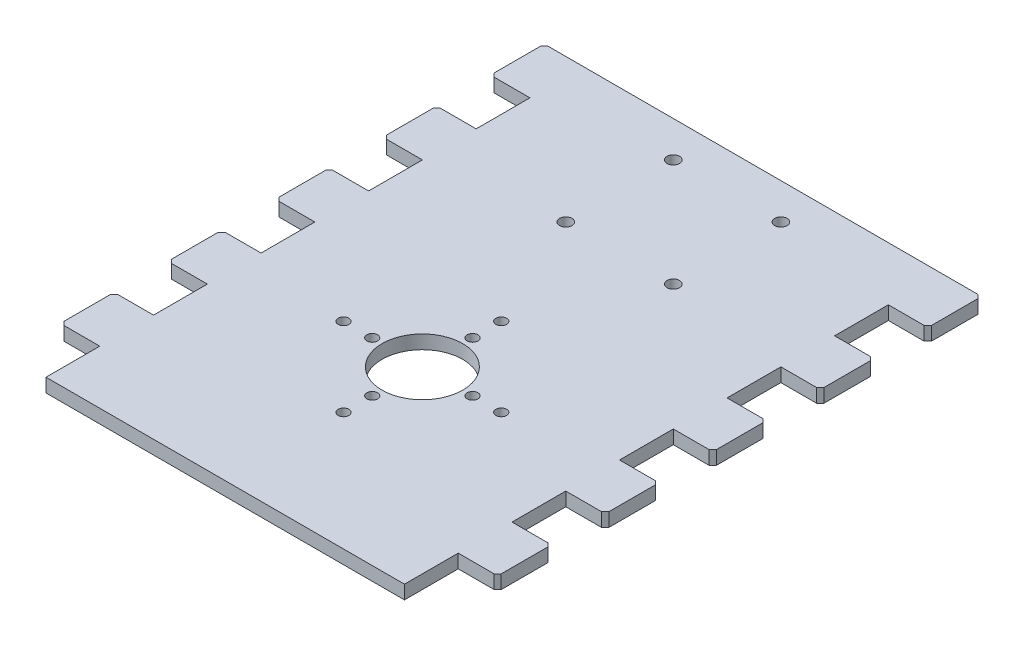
ISO-10303-21;
HEADER;
FILE_DESCRIPTION(('STEP AP214'),'2;1');
FILE_NAME('part.step','',(''),(''),'','','');
FILE_SCHEMA(('AUTOMOTIVE_DESIGN { 1 0 10303 214 1 1 1 1 }'));
ENDSEC;
DATA;
#1=APPLICATION_CONTEXT('core data for automotive mechanical design processes');
#2=APPLICATION_PROTOCOL_DEFINITION('international standard','automotive_design',2000,#1);
#3=PRODUCT_CONTEXT('',#1,'mechanical');
#4=PRODUCT('Part','Part','',(#3));
#5=PRODUCT_RELATED_PRODUCT_CATEGORY('part','',(#4));
#6=PRODUCT_DEFINITION_FORMATION('','',#4);
#7=PRODUCT_DEFINITION_CONTEXT('part definition',#1,'design');
#8=PRODUCT_DEFINITION('design','',#6,#7);
#9=PRODUCT_DEFINITION_SHAPE('','',#8);
#10=(LENGTH_UNIT() NAMED_UNIT(*) SI_UNIT(.MILLI.,.METRE.));
#11=(NAMED_UNIT(*) PLANE_ANGLE_UNIT() SI_UNIT($,.RADIAN.));
#12=(NAMED_UNIT(*) SI_UNIT($,.STERADIAN.) SOLID_ANGLE_UNIT());
#13=UNCERTAINTY_MEASURE_WITH_UNIT(LENGTH_MEASURE(1.E-05),#10,'distance_accuracy_value','');
#14=(GEOMETRIC_REPRESENTATION_CONTEXT(3) GLOBAL_UNCERTAINTY_ASSIGNED_CONTEXT((#13)) GLOBAL_UNIT_ASSIGNED_CONTEXT((#10,
#11,#12)) REPRESENTATION_CONTEXT('',''));
#15=CARTESIAN_POINT('',(0.,0.,0.));
#16=DIRECTION('',(0.,0.,1.));
#17=DIRECTION('',(1.,0.,0.));
#18=AXIS2_PLACEMENT_3D('',#15,#16,#17);
#19=CARTESIAN_POINT('',(0.,3.81,0.));
#20=DIRECTION('',(1.,0.,0.));
#21=DIRECTION('',(0.,0.,-1.));
#22=AXIS2_PLACEMENT_3D('',#19,#20,#21);
#23=PLANE('',#22);
#24=DIRECTION('',(0.,0.,1.));
#25=VECTOR('',#24,1.);
#26=CARTESIAN_POINT('',(0.,3.81,0.));
#27=LINE('',#26,#25);
#28=CARTESIAN_POINT('',(0.,3.81,-15.));
#29=VERTEX_POINT('',#28);
#30=CARTESIAN_POINT('',(0.,3.81,0.));
#31=VERTEX_POINT('',#30);
#32=EDGE_CURVE('E437',#29,#31,#27,.T.);
#33=ORIENTED_EDGE('',*,*,#32,.F.);
#34=DIRECTION('',(0.,1.,0.));
#35=VECTOR('',#34,1.);
#36=CARTESIAN_POINT('',(1.25693328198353E-12,-18.6010752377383,-15.));
#37=LINE('',#36,#35);
#38=CARTESIAN_POINT('',(1.25693328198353E-12,0.,-15.));
#39=VERTEX_POINT('',#38);
#40=EDGE_CURVE('E416',#39,#29,#37,.T.);
#41=ORIENTED_EDGE('',*,*,#40,.F.);
#42=DIRECTION('',(0.,0.,1.));
#43=VECTOR('',#42,1.);
#44=CARTESIAN_POINT('',(0.,0.,0.));
#45=LINE('',#44,#43);
#46=CARTESIAN_POINT('',(0.,0.,0.));
#47=VERTEX_POINT('',#46);
#48=EDGE_CURVE('E423',#39,#47,#45,.T.);
#49=ORIENTED_EDGE('',*,*,#48,.T.);
#50=DIRECTION('',(0.,-1.,0.));
#51=VECTOR('',#50,1.);
#52=CARTESIAN_POINT('',(0.,3.81,0.));
#53=LINE('',#52,#51);
#54=EDGE_CURVE('E722',#31,#47,#53,.T.);
#55=ORIENTED_EDGE('',*,*,#54,.F.);
#56=EDGE_LOOP('',(#33,#41,#49,#55));
#57=FACE_BOUND('',#56,.T.);
#58=ADVANCED_FACE('F33',(#57),#23,.F.);
#59=CARTESIAN_POINT('',(100.,3.81,0.));
#60=DIRECTION('',(-1.,0.,0.));
#61=DIRECTION('',(0.,0.,1.));
#62=AXIS2_PLACEMENT_3D('',#59,#60,#61);
#63=PLANE('',#62);
#64=DIRECTION('',(0.,0.,-1.));
#65=VECTOR('',#64,1.);
#66=CARTESIAN_POINT('',(100.,0.,0.));
#67=LINE('',#66,#65);
#68=CARTESIAN_POINT('',(100.,0.,0.));
#69=VERTEX_POINT('',#68);
#70=CARTESIAN_POINT('',(100.,0.,-15.));
#71=VERTEX_POINT('',#70);
#72=EDGE_CURVE('E714',#69,#71,#67,.T.);
#73=ORIENTED_EDGE('',*,*,#72,.T.);
#74=DIRECTION('',(0.,1.,0.));
#75=VECTOR('',#74,1.);
#76=CARTESIAN_POINT('',(100.000000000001,-18.6010752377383,-15.));
#77=LINE('',#76,#75);
#78=CARTESIAN_POINT('',(100.,3.81,-15.));
#79=VERTEX_POINT('',#78);
#80=EDGE_CURVE('E462',#71,#79,#77,.T.);
#81=ORIENTED_EDGE('',*,*,#80,.T.);
#82=DIRECTION('',(0.,0.,-1.));
#83=VECTOR('',#82,1.);
#84=CARTESIAN_POINT('',(100.,3.81,0.));
#85=LINE('',#84,#83);
#86=CARTESIAN_POINT('',(100.,3.81,0.));
#87=VERTEX_POINT('',#86);
#88=EDGE_CURVE('E703',#87,#79,#85,.T.);
#89=ORIENTED_EDGE('',*,*,#88,.F.);
#90=DIRECTION('',(0.,-1.,0.));
#91=VECTOR('',#90,1.);
#92=CARTESIAN_POINT('',(100.,3.81,0.));
#93=LINE('',#92,#91);
#94=EDGE_CURVE('E709',#87,#69,#93,.T.);
#95=ORIENTED_EDGE('',*,*,#94,.T.);
#96=EDGE_LOOP('',(#73,#81,#89,#95));
#97=FACE_BOUND('',#96,.T.);
#98=ADVANCED_FACE('F969',(#97),#63,.F.);
#99=CARTESIAN_POINT('',(9.42699961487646E-13,0.,-45.));
#100=VERTEX_POINT('',#99);
#101=CARTESIAN_POINT('',(0.,0.,-30.));
#102=VERTEX_POINT('',#101);
#103=EDGE_CURVE('E432',#100,#102,#45,.T.);
#104=ORIENTED_EDGE('',*,*,#103,.T.);
#105=DIRECTION('',(0.,1.,0.));
#106=VECTOR('',#105,1.);
#107=CARTESIAN_POINT('',(1.25693328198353E-12,-18.6010752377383,-30.));
#108=LINE('',#107,#106);
#109=CARTESIAN_POINT('',(0.,3.81,-30.));
#110=VERTEX_POINT('',#109);
#111=EDGE_CURVE('E438',#102,#110,#108,.T.);
#112=ORIENTED_EDGE('',*,*,#111,.T.);
#113=CARTESIAN_POINT('',(0.,3.81,-45.));
#114=VERTEX_POINT('',#113);
#115=EDGE_CURVE('E1023',#114,#110,#27,.T.);
#116=ORIENTED_EDGE('',*,*,#115,.F.);
#117=DIRECTION('',(0.,1.,0.));
#118=VECTOR('',#117,1.);
#119=CARTESIAN_POINT('',(9.42699961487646E-13,-18.6010752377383,-45.));
#120=LINE('',#119,#118);
#121=EDGE_CURVE('E482',#100,#114,#120,.T.);
#122=ORIENTED_EDGE('',*,*,#121,.F.);
#123=EDGE_LOOP('',(#104,#112,#116,#122));
#124=FACE_BOUND('',#123,.T.);
#125=ADVANCED_FACE('F971',(#124),#23,.F.);
#126=CARTESIAN_POINT('',(100.,3.81,-30.));
#127=VERTEX_POINT('',#126);
#128=CARTESIAN_POINT('',(100.,3.81,-45.));
#129=VERTEX_POINT('',#128);
#130=EDGE_CURVE('E707',#127,#129,#85,.T.);
#131=ORIENTED_EDGE('',*,*,#130,.F.);
#132=DIRECTION('',(0.,1.,0.));
#133=VECTOR('',#132,1.);
#134=CARTESIAN_POINT('',(100.000000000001,-18.6010752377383,-30.));
#135=LINE('',#134,#133);
#136=CARTESIAN_POINT('',(100.000000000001,0.,-30.));
#137=VERTEX_POINT('',#136);
#138=EDGE_CURVE('E457',#137,#127,#135,.T.);
#139=ORIENTED_EDGE('',*,*,#138,.F.);
#140=CARTESIAN_POINT('',(100.,0.,-45.));
#141=VERTEX_POINT('',#140);
#142=EDGE_CURVE('E717',#137,#141,#67,.T.);
#143=ORIENTED_EDGE('',*,*,#142,.T.);
#144=DIRECTION('',(0.,1.,0.));
#145=VECTOR('',#144,1.);
#146=CARTESIAN_POINT('',(100.000000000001,-18.6010752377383,-45.));
#147=LINE('',#146,#145);
#148=EDGE_CURVE('E504',#141,#129,#147,.T.);
#149=ORIENTED_EDGE('',*,*,#148,.T.);
#150=EDGE_LOOP('',(#131,#139,#143,#149));
#151=FACE_BOUND('',#150,.T.);
#152=ADVANCED_FACE('F977',(#151),#63,.F.);
#153=CARTESIAN_POINT('',(6.28466640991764E-13,0.,-75.));
#154=VERTEX_POINT('',#153);
#155=CARTESIAN_POINT('',(0.,0.,-60.));
#156=VERTEX_POINT('',#155);
#157=EDGE_CURVE('E1008',#154,#156,#45,.T.);
#158=ORIENTED_EDGE('',*,*,#157,.T.);
#159=DIRECTION('',(0.,1.,0.));
#160=VECTOR('',#159,1.);
#161=CARTESIAN_POINT('',(9.42699961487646E-13,-18.6010752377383,-60.));
#162=LINE('',#161,#160);
#163=CARTESIAN_POINT('',(0.,3.81,-60.));
#164=VERTEX_POINT('',#163);
#165=EDGE_CURVE('E480',#156,#164,#162,.T.);
#166=ORIENTED_EDGE('',*,*,#165,.T.);
#167=CARTESIAN_POINT('',(0.,3.81,-75.));
#168=VERTEX_POINT('',#167);
#169=EDGE_CURVE('E1021',#168,#164,#27,.T.);
#170=ORIENTED_EDGE('',*,*,#169,.F.);
#171=DIRECTION('',(0.,1.,0.));
#172=VECTOR('',#171,1.);
#173=CARTESIAN_POINT('',(6.28466640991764E-13,-18.6010752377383,-75.));
#174=LINE('',#173,#172);
#175=EDGE_CURVE('E525',#154,#168,#174,.T.);
#176=ORIENTED_EDGE('',*,*,#175,.F.);
#177=EDGE_LOOP('',(#158,#166,#170,#176));
#178=FACE_BOUND('',#177,.T.);
#179=ADVANCED_FACE('F983',(#178),#23,.F.);
#180=CARTESIAN_POINT('',(100.,3.81,-60.));
#181=VERTEX_POINT('',#180);
#182=CARTESIAN_POINT('',(100.,3.81,-75.));
#183=VERTEX_POINT('',#182);
#184=EDGE_CURVE('E1064',#181,#183,#85,.T.);
#185=ORIENTED_EDGE('',*,*,#184,.F.);
#186=DIRECTION('',(0.,1.,0.));
#187=VECTOR('',#186,1.);
#188=CARTESIAN_POINT('',(100.000000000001,-18.6010752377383,-60.));
#189=LINE('',#188,#187);
#190=CARTESIAN_POINT('',(100.000000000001,0.,-60.));
#191=VERTEX_POINT('',#190);
#192=EDGE_CURVE('E499',#191,#181,#189,.T.);
#193=ORIENTED_EDGE('',*,*,#192,.F.);
#194=CARTESIAN_POINT('',(100.,0.,-75.));
#195=VERTEX_POINT('',#194);
#196=EDGE_CURVE('E1074',#191,#195,#67,.T.);
#197=ORIENTED_EDGE('',*,*,#196,.T.);
#198=DIRECTION('',(0.,1.,0.));
#199=VECTOR('',#198,1.);
#200=CARTESIAN_POINT('',(100.000000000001,-18.6010752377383,-75.));
#201=LINE('',#200,#199);
#202=EDGE_CURVE('E547',#195,#183,#201,.T.);
#203=ORIENTED_EDGE('',*,*,#202,.T.);
#204=EDGE_LOOP('',(#185,#193,#197,#203));
#205=FACE_BOUND('',#204,.T.);
#206=ADVANCED_FACE('F993',(#205),#63,.F.);
#207=CARTESIAN_POINT('',(3.14233320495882E-13,0.,-105.));
#208=VERTEX_POINT('',#207);
#209=CARTESIAN_POINT('',(0.,0.,-90.));
#210=VERTEX_POINT('',#209);
#211=EDGE_CURVE('E711',#208,#210,#45,.T.);
#212=ORIENTED_EDGE('',*,*,#211,.T.);
#213=DIRECTION('',(0.,1.,0.));
#214=VECTOR('',#213,1.);
#215=CARTESIAN_POINT('',(6.28466640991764E-13,-18.6010752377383,-90.));
#216=LINE('',#215,#214);
#217=CARTESIAN_POINT('',(0.,3.81,-90.));
#218=VERTEX_POINT('',#217);
#219=EDGE_CURVE('E523',#210,#218,#216,.T.);
#220=ORIENTED_EDGE('',*,*,#219,.T.);
#221=CARTESIAN_POINT('',(0.,3.81,-105.));
#222=VERTEX_POINT('',#221);
#223=EDGE_CURVE('E700',#222,#218,#27,.T.);
#224=ORIENTED_EDGE('',*,*,#223,.F.);
#225=DIRECTION('',(0.,1.,0.));
#226=VECTOR('',#225,1.);
#227=CARTESIAN_POINT('',(3.14233320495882E-13,-18.6010752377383,-105.));
#228=LINE('',#227,#226);
#229=EDGE_CURVE('E566',#208,#222,#228,.T.);
#230=ORIENTED_EDGE('',*,*,#229,.F.);
#231=EDGE_LOOP('',(#212,#220,#224,#230));
#232=FACE_BOUND('',#231,.T.);
#233=ADVANCED_FACE('F986',(#232),#23,.F.);
#234=CARTESIAN_POINT('',(100.,3.81,-90.));
#235=VERTEX_POINT('',#234);
#236=CARTESIAN_POINT('',(100.,3.81,-105.));
#237=VERTEX_POINT('',#236);
#238=EDGE_CURVE('E1065',#235,#237,#85,.T.);
#239=ORIENTED_EDGE('',*,*,#238,.F.);
#240=DIRECTION('',(0.,1.,0.));
#241=VECTOR('',#240,1.);
#242=CARTESIAN_POINT('',(100.000000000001,-18.6010752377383,-90.));
#243=LINE('',#242,#241);
#244=CARTESIAN_POINT('',(100.000000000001,0.,-90.));
#245=VERTEX_POINT('',#244);
#246=EDGE_CURVE('E542',#245,#235,#243,.T.);
#247=ORIENTED_EDGE('',*,*,#246,.F.);
#248=CARTESIAN_POINT('',(100.,0.,-105.));
#249=VERTEX_POINT('',#248);
#250=EDGE_CURVE('E1073',#245,#249,#67,.T.);
#251=ORIENTED_EDGE('',*,*,#250,.T.);
#252=DIRECTION('',(0.,1.,0.));
#253=VECTOR('',#252,1.);
#254=CARTESIAN_POINT('',(100.,-18.6010752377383,-105.));
#255=LINE('',#254,#253);
#256=EDGE_CURVE('E588',#249,#237,#255,.T.);
#257=ORIENTED_EDGE('',*,*,#256,.T.);
#258=EDGE_LOOP('',(#239,#247,#251,#257));
#259=FACE_BOUND('',#258,.T.);
#260=ADVANCED_FACE('F985',(#259),#63,.F.);
#261=CARTESIAN_POINT('',(0.,0.,-135.));
#262=VERTEX_POINT('',#261);
#263=CARTESIAN_POINT('',(0.,0.,-120.));
#264=VERTEX_POINT('',#263);
#265=EDGE_CURVE('E435',#262,#264,#45,.T.);
#266=ORIENTED_EDGE('',*,*,#265,.T.);
#267=DIRECTION('',(0.,1.,0.));
#268=VECTOR('',#267,1.);
#269=CARTESIAN_POINT('',(3.14233320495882E-13,-18.6010752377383,-120.));
#270=LINE('',#269,#268);
#271=CARTESIAN_POINT('',(0.,3.81,-120.));
#272=VERTEX_POINT('',#271);
#273=EDGE_CURVE('E564',#264,#272,#270,.T.);
#274=ORIENTED_EDGE('',*,*,#273,.T.);
#275=CARTESIAN_POINT('',(0.,3.81,-135.));
#276=VERTEX_POINT('',#275);
#277=EDGE_CURVE('E696',#276,#272,#27,.T.);
#278=ORIENTED_EDGE('',*,*,#277,.F.);
#279=DIRECTION('',(0.,1.,0.));
#280=VECTOR('',#279,1.);
#281=CARTESIAN_POINT('',(0.,-18.6010752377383,-135.));
#282=LINE('',#281,#280);
#283=EDGE_CURVE('E601',#262,#276,#282,.T.);
#284=ORIENTED_EDGE('',*,*,#283,.F.);
#285=EDGE_LOOP('',(#266,#274,#278,#284));
#286=FACE_BOUND('',#285,.T.);
#287=ADVANCED_FACE('F944',(#286),#23,.F.);
#288=CARTESIAN_POINT('',(0.,3.81,0.));
#289=DIRECTION('',(0.,-1.,0.));
#290=DIRECTION('',(0.,0.,-1.));
#291=AXIS2_PLACEMENT_3D('',#288,#289,#290);
#292=PLANE('',#291);
#293=DIRECTION('',(-1.,0.,0.));
#294=VECTOR('',#293,1.);
#295=CARTESIAN_POINT('',(0.,3.81,-150.));
#296=LINE('',#295,#294);
#297=CARTESIAN_POINT('',(110.,3.81,-150.));
#298=VERTEX_POINT('',#297);
#299=CARTESIAN_POINT('',(-9.99999999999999,3.81,-150.));
#300=VERTEX_POINT('',#299);
#301=EDGE_CURVE('E706',#298,#300,#296,.T.);
#302=ORIENTED_EDGE('',*,*,#301,.T.);
#303=DIRECTION('',(-0.707106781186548,0.,0.707106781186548));
#304=VECTOR('',#303,1.);
#305=CARTESIAN_POINT('',(-9.99999999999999,3.81,-150.));
#306=LINE('',#305,#304);
#307=CARTESIAN_POINT('',(-11.,3.81,-149.));
#308=VERTEX_POINT('',#307);
#309=EDGE_CURVE('E767',#300,#308,#306,.T.);
#310=ORIENTED_EDGE('',*,*,#309,.T.);
#311=DIRECTION('',(0.,0.,1.));
#312=VECTOR('',#311,1.);
#313=CARTESIAN_POINT('',(-11.,3.81,-150.));
#314=LINE('',#313,#312);
#315=CARTESIAN_POINT('',(-11.,3.81,-136.));
#316=VERTEX_POINT('',#315);
#317=EDGE_CURVE('E591',#308,#316,#314,.T.);
#318=ORIENTED_EDGE('',*,*,#317,.T.);
#319=DIRECTION('',(-0.707106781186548,0.,-0.707106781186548));
#320=VECTOR('',#319,1.);
#321=CARTESIAN_POINT('',(-11.,3.81,-136.));
#322=LINE('',#321,#320);
#323=CARTESIAN_POINT('',(-9.99999999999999,3.81,-135.));
#324=VERTEX_POINT('',#323);
#325=EDGE_CURVE('E765',#316,#324,#322,.F.);
#326=ORIENTED_EDGE('',*,*,#325,.T.);
#327=DIRECTION('',(1.,0.,0.));
#328=VECTOR('',#327,1.);
#329=CARTESIAN_POINT('',(0.,3.81,-135.));
#330=LINE('',#329,#328);
#331=EDGE_CURVE('E592',#324,#276,#330,.T.);
#332=ORIENTED_EDGE('',*,*,#331,.T.);
#333=ORIENTED_EDGE('',*,*,#277,.T.);
#334=DIRECTION('',(-1.,0.,0.));
#335=VECTOR('',#334,1.);
#336=CARTESIAN_POINT('',(3.14233320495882E-13,3.81,-120.));
#337=LINE('',#336,#335);
#338=CARTESIAN_POINT('',(-9.99999999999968,3.81,-120.));
#339=VERTEX_POINT('',#338);
#340=EDGE_CURVE('E550',#272,#339,#337,.T.);
#341=ORIENTED_EDGE('',*,*,#340,.T.);
#342=DIRECTION('',(0.707106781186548,0.,-0.707106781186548));
#343=VECTOR('',#342,1.);
#344=CARTESIAN_POINT('',(-9.99999999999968,3.81,-120.));
#345=LINE('',#344,#343);
#346=CARTESIAN_POINT('',(-10.9999999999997,3.81,-119.));
#347=VERTEX_POINT('',#346);
#348=EDGE_CURVE('E763',#339,#347,#345,.F.);
#349=ORIENTED_EDGE('',*,*,#348,.T.);
#350=DIRECTION('',(0.,0.,1.));
#351=VECTOR('',#350,1.);
#352=CARTESIAN_POINT('',(-10.9999999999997,3.81,-120.));
#353=LINE('',#352,#351);
#354=CARTESIAN_POINT('',(-10.9999999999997,3.81,-106.));
#355=VERTEX_POINT('',#354);
#356=EDGE_CURVE('E554',#347,#355,#353,.T.);
#357=ORIENTED_EDGE('',*,*,#356,.T.);
#358=DIRECTION('',(-0.707106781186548,0.,-0.707106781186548));
#359=VECTOR('',#358,1.);
#360=CARTESIAN_POINT('',(-10.9999999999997,3.81,-106.));
#361=LINE('',#360,#359);
#362=CARTESIAN_POINT('',(-9.99999999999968,3.81,-105.));
#363=VERTEX_POINT('',#362);
#364=EDGE_CURVE('E761',#355,#363,#361,.F.);
#365=ORIENTED_EDGE('',*,*,#364,.T.);
#366=DIRECTION('',(1.,0.,0.));
#367=VECTOR('',#366,1.);
#368=CARTESIAN_POINT('',(3.14233320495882E-13,3.81,-105.));
#369=LINE('',#368,#367);
#370=EDGE_CURVE('E551',#363,#222,#369,.T.);
#371=ORIENTED_EDGE('',*,*,#370,.T.);
#372=ORIENTED_EDGE('',*,*,#223,.T.);
#373=DIRECTION('',(-1.,0.,0.));
#374=VECTOR('',#373,1.);
#375=CARTESIAN_POINT('',(6.28466640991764E-13,3.81,-90.));
#376=LINE('',#375,#374);
#377=CARTESIAN_POINT('',(-9.99999999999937,3.81,-90.));
#378=VERTEX_POINT('',#377);
#379=EDGE_CURVE('E507',#218,#378,#376,.T.);
#380=ORIENTED_EDGE('',*,*,#379,.T.);
#381=DIRECTION('',(0.707106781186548,0.,-0.707106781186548));
#382=VECTOR('',#381,1.);
#383=CARTESIAN_POINT('',(-9.99999999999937,3.81,-90.));
#384=LINE('',#383,#382);
#385=CARTESIAN_POINT('',(-10.9999999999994,3.81,-89.));
#386=VERTEX_POINT('',#385);
#387=EDGE_CURVE('E759',#378,#386,#384,.F.);
#388=ORIENTED_EDGE('',*,*,#387,.T.);
#389=DIRECTION('',(0.,0.,1.));
#390=VECTOR('',#389,1.);
#391=CARTESIAN_POINT('',(-10.9999999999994,3.81,-90.));
#392=LINE('',#391,#390);
#393=CARTESIAN_POINT('',(-10.9999999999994,3.81,-76.));
#394=VERTEX_POINT('',#393);
#395=EDGE_CURVE('E511',#386,#394,#392,.T.);
#396=ORIENTED_EDGE('',*,*,#395,.T.);
#397=DIRECTION('',(-0.707106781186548,0.,-0.707106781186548));
#398=VECTOR('',#397,1.);
#399=CARTESIAN_POINT('',(-10.9999999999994,3.81,-76.));
#400=LINE('',#399,#398);
#401=CARTESIAN_POINT('',(-9.99999999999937,3.81,-75.));
#402=VERTEX_POINT('',#401);
#403=EDGE_CURVE('E757',#394,#402,#400,.F.);
#404=ORIENTED_EDGE('',*,*,#403,.T.);
#405=DIRECTION('',(1.,0.,0.));
#406=VECTOR('',#405,1.);
#407=CARTESIAN_POINT('',(6.28466640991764E-13,3.81,-75.));
#408=LINE('',#407,#406);
#409=EDGE_CURVE('E508',#402,#168,#408,.T.);
#410=ORIENTED_EDGE('',*,*,#409,.T.);
#411=ORIENTED_EDGE('',*,*,#169,.T.);
#412=DIRECTION('',(-1.,0.,0.));
#413=VECTOR('',#412,1.);
#414=CARTESIAN_POINT('',(9.42699961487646E-13,3.81,-60.));
#415=LINE('',#414,#413);
#416=CARTESIAN_POINT('',(-9.99999999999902,3.81,-60.));
#417=VERTEX_POINT('',#416);
#418=EDGE_CURVE('E464',#164,#417,#415,.T.);
#419=ORIENTED_EDGE('',*,*,#418,.T.);
#420=DIRECTION('',(0.707106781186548,0.,-0.707106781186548));
#421=VECTOR('',#420,1.);
#422=CARTESIAN_POINT('',(-9.99999999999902,3.81,-60.));
#423=LINE('',#422,#421);
#424=CARTESIAN_POINT('',(-10.9999999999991,3.81,-59.));
#425=VERTEX_POINT('',#424);
#426=EDGE_CURVE('E755',#417,#425,#423,.F.);
#427=ORIENTED_EDGE('',*,*,#426,.T.);
#428=DIRECTION('',(0.,0.,1.));
#429=VECTOR('',#428,1.);
#430=CARTESIAN_POINT('',(-10.9999999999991,3.81,-60.));
#431=LINE('',#430,#429);
#432=CARTESIAN_POINT('',(-10.9999999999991,3.81,-46.));
#433=VERTEX_POINT('',#432);
#434=EDGE_CURVE('E468',#425,#433,#431,.T.);
#435=ORIENTED_EDGE('',*,*,#434,.T.);
#436=DIRECTION('',(-0.707106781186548,0.,-0.707106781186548));
#437=VECTOR('',#436,1.);
#438=CARTESIAN_POINT('',(-10.9999999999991,3.81,-46.));
#439=LINE('',#438,#437);
#440=CARTESIAN_POINT('',(-9.99999999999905,3.81,-45.));
#441=VERTEX_POINT('',#440);
#442=EDGE_CURVE('E753',#433,#441,#439,.F.);
#443=ORIENTED_EDGE('',*,*,#442,.T.);
#444=DIRECTION('',(1.,0.,0.));
#445=VECTOR('',#444,1.);
#446=CARTESIAN_POINT('',(9.42699961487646E-13,3.81,-45.));
#447=LINE('',#446,#445);
#448=EDGE_CURVE('E465',#441,#114,#447,.T.);
#449=ORIENTED_EDGE('',*,*,#448,.T.);
#450=ORIENTED_EDGE('',*,*,#115,.T.);
#451=DIRECTION('',(-1.,0.,0.));
#452=VECTOR('',#451,1.);
#453=CARTESIAN_POINT('',(1.25693328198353E-12,3.81,-30.));
#454=LINE('',#453,#452);
#455=CARTESIAN_POINT('',(-9.99999999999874,3.81,-30.));
#456=VERTEX_POINT('',#455);
#457=EDGE_CURVE('E1911',#110,#456,#454,.T.);
#458=ORIENTED_EDGE('',*,*,#457,.T.);
#459=DIRECTION('',(0.707106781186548,0.,-0.707106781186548));
#460=VECTOR('',#459,1.);
#461=CARTESIAN_POINT('',(-9.99999999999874,3.81,-30.));
#462=LINE('',#461,#460);
#463=CARTESIAN_POINT('',(-10.9999999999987,3.81,-29.));
#464=VERTEX_POINT('',#463);
#465=EDGE_CURVE('E751',#456,#464,#462,.F.);
#466=ORIENTED_EDGE('',*,*,#465,.T.);
#467=DIRECTION('',(0.,0.,1.));
#468=VECTOR('',#467,1.);
#469=CARTESIAN_POINT('',(-10.9999999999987,3.81,-30.));
#470=LINE('',#469,#468);
#471=CARTESIAN_POINT('',(-10.9999999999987,3.81,-16.));
#472=VERTEX_POINT('',#471);
#473=EDGE_CURVE('E1912',#464,#472,#470,.T.);
#474=ORIENTED_EDGE('',*,*,#473,.T.);
#475=DIRECTION('',(-0.707106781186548,0.,-0.707106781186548));
#476=VECTOR('',#475,1.);
#477=CARTESIAN_POINT('',(-10.9999999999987,3.81,-16.));
#478=LINE('',#477,#476);
#479=CARTESIAN_POINT('',(-9.99999999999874,3.81,-15.));
#480=VERTEX_POINT('',#479);
#481=EDGE_CURVE('E749',#472,#480,#478,.F.);
#482=ORIENTED_EDGE('',*,*,#481,.T.);
#483=DIRECTION('',(1.,0.,0.));
#484=VECTOR('',#483,1.);
#485=CARTESIAN_POINT('',(1.25693328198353E-12,3.81,-15.));
#486=LINE('',#485,#484);
#487=EDGE_CURVE('E1031',#480,#29,#486,.T.);
#488=ORIENTED_EDGE('',*,*,#487,.T.);
#489=ORIENTED_EDGE('',*,*,#32,.T.);
#490=DIRECTION('',(1.,0.,0.));
#491=VECTOR('',#490,1.);
#492=CARTESIAN_POINT('',(0.,3.81,0.));
#493=LINE('',#492,#491);
#494=EDGE_CURVE('E699',#31,#87,#493,.T.);
#495=ORIENTED_EDGE('',*,*,#494,.T.);
#496=ORIENTED_EDGE('',*,*,#88,.T.);
#497=DIRECTION('',(1.,0.,0.));
#498=VECTOR('',#497,1.);
#499=CARTESIAN_POINT('',(100.000000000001,3.81,-15.));
#500=LINE('',#499,#498);
#501=CARTESIAN_POINT('',(110.000000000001,3.81,-15.));
#502=VERTEX_POINT('',#501);
#503=EDGE_CURVE('E449',#79,#502,#500,.T.);
#504=ORIENTED_EDGE('',*,*,#503,.T.);
#505=DIRECTION('',(-0.707106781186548,0.,0.707106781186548));
#506=VECTOR('',#505,1.);
#507=CARTESIAN_POINT('',(110.000000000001,3.81,-15.));
#508=LINE('',#507,#506);
#509=CARTESIAN_POINT('',(111.000000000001,3.81,-16.));
#510=VERTEX_POINT('',#509);
#511=EDGE_CURVE('E747',#502,#510,#508,.F.);
#512=ORIENTED_EDGE('',*,*,#511,.T.);
#513=DIRECTION('',(0.,0.,-1.));
#514=VECTOR('',#513,1.);
#515=CARTESIAN_POINT('',(111.000000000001,3.81,-30.));
#516=LINE('',#515,#514);
#517=CARTESIAN_POINT('',(111.000000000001,3.81,-29.));
#518=VERTEX_POINT('',#517);
#519=EDGE_CURVE('E446',#510,#518,#516,.T.);
#520=ORIENTED_EDGE('',*,*,#519,.T.);
#521=DIRECTION('',(0.707106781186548,0.,0.707106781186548));
#522=VECTOR('',#521,1.);
#523=CARTESIAN_POINT('',(111.000000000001,3.81,-29.));
#524=LINE('',#523,#522);
#525=CARTESIAN_POINT('',(110.000000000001,3.81,-30.));
#526=VERTEX_POINT('',#525);
#527=EDGE_CURVE('E745',#518,#526,#524,.F.);
#528=ORIENTED_EDGE('',*,*,#527,.T.);
#529=DIRECTION('',(-1.,0.,0.));
#530=VECTOR('',#529,1.);
#531=CARTESIAN_POINT('',(100.000000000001,3.81,-30.));
#532=LINE('',#531,#530);
#533=EDGE_CURVE('E443',#526,#127,#532,.T.);
#534=ORIENTED_EDGE('',*,*,#533,.T.);
#535=ORIENTED_EDGE('',*,*,#130,.T.);
#536=DIRECTION('',(1.,0.,0.));
#537=VECTOR('',#536,1.);
#538=CARTESIAN_POINT('',(100.000000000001,3.81,-45.));
#539=LINE('',#538,#537);
#540=CARTESIAN_POINT('',(110.000000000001,3.81,-45.));
#541=VERTEX_POINT('',#540);
#542=EDGE_CURVE('E479',#129,#541,#539,.T.);
#543=ORIENTED_EDGE('',*,*,#542,.T.);
#544=DIRECTION('',(-0.707106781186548,0.,0.707106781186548));
#545=VECTOR('',#544,1.);
#546=CARTESIAN_POINT('',(110.000000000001,3.81,-45.));
#547=LINE('',#546,#545);
#548=CARTESIAN_POINT('',(111.000000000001,3.81,-46.));
#549=VERTEX_POINT('',#548);
#550=EDGE_CURVE('E743',#541,#549,#547,.F.);
#551=ORIENTED_EDGE('',*,*,#550,.T.);
#552=DIRECTION('',(0.,0.,-1.));
#553=VECTOR('',#552,1.);
#554=CARTESIAN_POINT('',(111.000000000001,3.81,-60.));
#555=LINE('',#554,#553);
#556=CARTESIAN_POINT('',(111.000000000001,3.81,-59.));
#557=VERTEX_POINT('',#556);
#558=EDGE_CURVE('E489',#549,#557,#555,.T.);
#559=ORIENTED_EDGE('',*,*,#558,.T.);
#560=DIRECTION('',(0.707106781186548,0.,0.707106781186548));
#561=VECTOR('',#560,1.);
#562=CARTESIAN_POINT('',(111.000000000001,3.81,-59.));
#563=LINE('',#562,#561);
#564=CARTESIAN_POINT('',(110.000000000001,3.81,-60.));
#565=VERTEX_POINT('',#564);
#566=EDGE_CURVE('E741',#557,#565,#563,.F.);
#567=ORIENTED_EDGE('',*,*,#566,.T.);
#568=DIRECTION('',(-1.,0.,0.));
#569=VECTOR('',#568,1.);
#570=CARTESIAN_POINT('',(100.000000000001,3.81,-60.));
#571=LINE('',#570,#569);
#572=EDGE_CURVE('E486',#565,#181,#571,.T.);
#573=ORIENTED_EDGE('',*,*,#572,.T.);
#574=ORIENTED_EDGE('',*,*,#184,.T.);
#575=DIRECTION('',(1.,0.,0.));
#576=VECTOR('',#575,1.);
#577=CARTESIAN_POINT('',(100.000000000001,3.81,-75.));
#578=LINE('',#577,#576);
#579=CARTESIAN_POINT('',(110.000000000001,3.81,-75.));
#580=VERTEX_POINT('',#579);
#581=EDGE_CURVE('E522',#183,#580,#578,.T.);
#582=ORIENTED_EDGE('',*,*,#581,.T.);
#583=DIRECTION('',(-0.707106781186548,0.,0.707106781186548));
#584=VECTOR('',#583,1.);
#585=CARTESIAN_POINT('',(110.000000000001,3.81,-75.));
#586=LINE('',#585,#584);
#587=CARTESIAN_POINT('',(111.000000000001,3.81,-76.));
#588=VERTEX_POINT('',#587);
#589=EDGE_CURVE('E739',#580,#588,#586,.F.);
#590=ORIENTED_EDGE('',*,*,#589,.T.);
#591=DIRECTION('',(0.,0.,-1.));
#592=VECTOR('',#591,1.);
#593=CARTESIAN_POINT('',(111.000000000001,3.81,-90.));
#594=LINE('',#593,#592);
#595=CARTESIAN_POINT('',(111.000000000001,3.81,-89.));
#596=VERTEX_POINT('',#595);
#597=EDGE_CURVE('E532',#588,#596,#594,.T.);
#598=ORIENTED_EDGE('',*,*,#597,.T.);
#599=DIRECTION('',(0.707106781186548,0.,0.707106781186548));
#600=VECTOR('',#599,1.);
#601=CARTESIAN_POINT('',(111.000000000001,3.81,-89.));
#602=LINE('',#601,#600);
#603=CARTESIAN_POINT('',(110.000000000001,3.81,-90.));
#604=VERTEX_POINT('',#603);
#605=EDGE_CURVE('E737',#596,#604,#602,.F.);
#606=ORIENTED_EDGE('',*,*,#605,.T.);
#607=DIRECTION('',(-1.,0.,0.));
#608=VECTOR('',#607,1.);
#609=CARTESIAN_POINT('',(100.000000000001,3.81,-90.));
#610=LINE('',#609,#608);
#611=EDGE_CURVE('E529',#604,#235,#610,.T.);
#612=ORIENTED_EDGE('',*,*,#611,.T.);
#613=ORIENTED_EDGE('',*,*,#238,.T.);
#614=DIRECTION('',(1.,0.,0.));
#615=VECTOR('',#614,1.);
#616=CARTESIAN_POINT('',(100.,3.81,-105.));
#617=LINE('',#616,#615);
#618=CARTESIAN_POINT('',(110.,3.81,-105.));
#619=VERTEX_POINT('',#618);
#620=EDGE_CURVE('E563',#237,#619,#617,.T.);
#621=ORIENTED_EDGE('',*,*,#620,.T.);
#622=DIRECTION('',(-0.707106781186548,0.,0.707106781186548));
#623=VECTOR('',#622,1.);
#624=CARTESIAN_POINT('',(110.,3.81,-105.));
#625=LINE('',#624,#623);
#626=CARTESIAN_POINT('',(111.,3.81,-106.));
#627=VERTEX_POINT('',#626);
#628=EDGE_CURVE('E735',#619,#627,#625,.F.);
#629=ORIENTED_EDGE('',*,*,#628,.T.);
#630=DIRECTION('',(0.,0.,-1.));
#631=VECTOR('',#630,1.);
#632=CARTESIAN_POINT('',(111.,3.81,-120.));
#633=LINE('',#632,#631);
#634=CARTESIAN_POINT('',(111.,3.81,-119.));
#635=VERTEX_POINT('',#634);
#636=EDGE_CURVE('E573',#627,#635,#633,.T.);
#637=ORIENTED_EDGE('',*,*,#636,.T.);
#638=DIRECTION('',(0.707106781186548,0.,0.707106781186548));
#639=VECTOR('',#638,1.);
#640=CARTESIAN_POINT('',(111.,3.81,-119.));
#641=LINE('',#640,#639);
#642=CARTESIAN_POINT('',(110.,3.81,-120.));
#643=VERTEX_POINT('',#642);
#644=EDGE_CURVE('E733',#635,#643,#641,.F.);
#645=ORIENTED_EDGE('',*,*,#644,.T.);
#646=DIRECTION('',(-1.,0.,0.));
#647=VECTOR('',#646,1.);
#648=CARTESIAN_POINT('',(100.,3.81,-120.));
#649=LINE('',#648,#647);
#650=CARTESIAN_POINT('',(100.,3.81,-120.));
#651=VERTEX_POINT('',#650);
#652=EDGE_CURVE('E570',#643,#651,#649,.T.);
#653=ORIENTED_EDGE('',*,*,#652,.T.);
#654=CARTESIAN_POINT('',(100.,3.81,-135.));
#655=VERTEX_POINT('',#654);
#656=EDGE_CURVE('E702',#651,#655,#85,.T.);
#657=ORIENTED_EDGE('',*,*,#656,.T.);
#658=DIRECTION('',(1.,0.,0.));
#659=VECTOR('',#658,1.);
#660=CARTESIAN_POINT('',(100.,3.81,-135.));
#661=LINE('',#660,#659);
#662=CARTESIAN_POINT('',(110.,3.81,-135.));
#663=VERTEX_POINT('',#662);
#664=EDGE_CURVE('E604',#655,#663,#661,.T.);
#665=ORIENTED_EDGE('',*,*,#664,.T.);
#666=DIRECTION('',(-0.707106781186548,0.,0.707106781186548));
#667=VECTOR('',#666,1.);
#668=CARTESIAN_POINT('',(110.,3.81,-135.));
#669=LINE('',#668,#667);
#670=CARTESIAN_POINT('',(111.,3.81,-136.));
#671=VERTEX_POINT('',#670);
#672=EDGE_CURVE('E731',#663,#671,#669,.F.);
#673=ORIENTED_EDGE('',*,*,#672,.T.);
#674=DIRECTION('',(0.,0.,-1.));
#675=VECTOR('',#674,1.);
#676=CARTESIAN_POINT('',(111.,3.81,-150.));
#677=LINE('',#676,#675);
#678=CARTESIAN_POINT('',(111.,3.81,-149.));
#679=VERTEX_POINT('',#678);
#680=EDGE_CURVE('E605',#671,#679,#677,.T.);
#681=ORIENTED_EDGE('',*,*,#680,.T.);
#682=DIRECTION('',(-0.707106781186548,0.,-0.707106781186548));
#683=VECTOR('',#682,1.);
#684=CARTESIAN_POINT('',(111.,3.81,-149.));
#685=LINE('',#684,#683);
#686=EDGE_CURVE('E729',#679,#298,#685,.T.);
#687=ORIENTED_EDGE('',*,*,#686,.T.);
#688=EDGE_LOOP('',(#302,#310,#318,#326,#332,#333,#341,#349,#357,#365,#371,#372,#380,#388,#396,
#404,#410,#411,#419,#427,#435,#443,#449,#450,#458,#466,#474,#482,#488,#489,#495,#496,#504,#512,
#520,#528,#534,#535,#543,#551,#559,#567,#573,#574,#582,#590,#598,#606,#612,#613,#621,#629,#637,
#645,#653,#657,#665,#673,#681,#687));
#689=FACE_BOUND('',#688,.T.);
#690=CARTESIAN_POINT('',(50.,3.81,-55.));
#691=DIRECTION('',(0.,1.,0.));
#692=DIRECTION('',(0.,0.,1.));
#693=AXIS2_PLACEMENT_3D('',#690,#691,#692);
#694=CIRCLE('',#693,11.25);
#695=CARTESIAN_POINT('',(50.,3.81,-43.75));
#696=VERTEX_POINT('',#695);
#697=EDGE_CURVE('E433',#696,#696,#694,.T.);
#698=ORIENTED_EDGE('',*,*,#697,.F.);
#699=EDGE_LOOP('',(#698));
#700=FACE_BOUND('',#699,.T.);
#701=CARTESIAN_POINT('',(50.,3.81,-69.));
#702=DIRECTION('',(0.,1.,0.));
#703=DIRECTION('',(0.,0.,1.));
#704=AXIS2_PLACEMENT_3D('',#701,#702,#703);
#705=CIRCLE('',#704,1.5);
#706=CARTESIAN_POINT('',(50.,3.81,-67.5));
#707=VERTEX_POINT('',#706);
#708=EDGE_CURVE('E686',#707,#707,#705,.T.);
#709=ORIENTED_EDGE('',*,*,#708,.F.);
#710=EDGE_LOOP('',(#709));
#711=FACE_BOUND('',#710,.T.);
#712=CARTESIAN_POINT('',(50.,3.81,-77.));
#713=DIRECTION('',(0.,1.,0.));
#714=DIRECTION('',(0.,0.,1.));
#715=AXIS2_PLACEMENT_3D('',#712,#713,#714);
#716=CIRCLE('',#715,1.5);
#717=CARTESIAN_POINT('',(50.,3.81,-75.5));
#718=VERTEX_POINT('',#717);
#719=EDGE_CURVE('E680',#718,#718,#716,.T.);
#720=ORIENTED_EDGE('',*,*,#719,.F.);
#721=EDGE_LOOP('',(#720));
#722=FACE_BOUND('',#721,.T.);
#723=CARTESIAN_POINT('',(64.0000000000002,3.81,-55.0000000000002));
#724=DIRECTION('',(0.,1.,0.));
#725=DIRECTION('',(0.,0.,1.));
#726=AXIS2_PLACEMENT_3D('',#723,#724,#725);
#727=CIRCLE('',#726,1.5);
#728=CARTESIAN_POINT('',(64.0000000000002,3.81,-53.5000000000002));
#729=VERTEX_POINT('',#728);
#730=EDGE_CURVE('E674',#729,#729,#727,.T.);
#731=ORIENTED_EDGE('',*,*,#730,.F.);
#732=EDGE_LOOP('',(#731));
#733=FACE_BOUND('',#732,.T.);
#734=CARTESIAN_POINT('',(72.0000000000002,3.81,-55.0000000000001));
#735=DIRECTION('',(0.,1.,0.));
#736=DIRECTION('',(0.,0.,1.));
#737=AXIS2_PLACEMENT_3D('',#734,#735,#736);
#738=CIRCLE('',#737,1.5);
#739=CARTESIAN_POINT('',(72.0000000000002,3.81,-53.5000000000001));
#740=VERTEX_POINT('',#739);
#741=EDGE_CURVE('E668',#740,#740,#738,.T.);
#742=ORIENTED_EDGE('',*,*,#741,.F.);
#743=EDGE_LOOP('',(#742));
#744=FACE_BOUND('',#743,.T.);
#745=CARTESIAN_POINT('',(50.0000000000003,3.81,-41.));
#746=DIRECTION('',(0.,1.,0.));
#747=DIRECTION('',(0.,0.,1.));
#748=AXIS2_PLACEMENT_3D('',#745,#746,#747);
#749=CIRCLE('',#748,1.50000000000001);
#750=CARTESIAN_POINT('',(50.0000000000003,3.81,-39.5));
#751=VERTEX_POINT('',#750);
#752=EDGE_CURVE('E662',#751,#751,#749,.T.);
#753=ORIENTED_EDGE('',*,*,#752,.F.);
#754=EDGE_LOOP('',(#753));
#755=FACE_BOUND('',#754,.T.);
#756=CARTESIAN_POINT('',(50.0000000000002,3.81,-33.));
#757=DIRECTION('',(0.,1.,0.));
#758=DIRECTION('',(0.,0.,1.));
#759=AXIS2_PLACEMENT_3D('',#756,#757,#758);
#760=CIRCLE('',#759,1.50000000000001);
#761=CARTESIAN_POINT('',(50.0000000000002,3.81,-31.5));
#762=VERTEX_POINT('',#761);
#763=EDGE_CURVE('E656',#762,#762,#760,.T.);
#764=ORIENTED_EDGE('',*,*,#763,.F.);
#765=EDGE_LOOP('',(#764));
#766=FACE_BOUND('',#765,.T.);
#767=CARTESIAN_POINT('',(36.0000000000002,3.81,-55.));
#768=DIRECTION('',(0.,1.,0.));
#769=DIRECTION('',(0.,0.,1.));
#770=AXIS2_PLACEMENT_3D('',#767,#768,#769);
#771=CIRCLE('',#770,1.50000000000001);
#772=CARTESIAN_POINT('',(36.0000000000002,3.81,-53.5));
#773=VERTEX_POINT('',#772);
#774=EDGE_CURVE('E650',#773,#773,#771,.T.);
#775=ORIENTED_EDGE('',*,*,#774,.F.);
#776=EDGE_LOOP('',(#775));
#777=FACE_BOUND('',#776,.T.);
#778=CARTESIAN_POINT('',(28.0000000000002,3.81,-55.0000000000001));
#779=DIRECTION('',(0.,1.,0.));
#780=DIRECTION('',(0.,0.,1.));
#781=AXIS2_PLACEMENT_3D('',#778,#779,#780);
#782=CIRCLE('',#781,1.50000000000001);
#783=CARTESIAN_POINT('',(28.0000000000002,3.81,-53.5));
#784=VERTEX_POINT('',#783);
#785=EDGE_CURVE('E644',#784,#784,#782,.T.);
#786=ORIENTED_EDGE('',*,*,#785,.F.);
#787=EDGE_LOOP('',(#786));
#788=FACE_BOUND('',#787,.T.);
#789=CARTESIAN_POINT('',(65.,3.81,-140.));
#790=DIRECTION('',(0.,1.,0.));
#791=DIRECTION('',(0.,0.,1.));
#792=AXIS2_PLACEMENT_3D('',#789,#790,#791);
#793=CIRCLE('',#792,1.75000000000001);
#794=CARTESIAN_POINT('',(65.,3.81,-138.25));
#795=VERTEX_POINT('',#794);
#796=EDGE_CURVE('E638',#795,#795,#793,.T.);
#797=ORIENTED_EDGE('',*,*,#796,.F.);
#798=EDGE_LOOP('',(#797));
#799=FACE_BOUND('',#798,.T.);
#800=CARTESIAN_POINT('',(65.0000000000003,3.81,-110.));
#801=DIRECTION('',(0.,1.,0.));
#802=DIRECTION('',(0.,0.,1.));
#803=AXIS2_PLACEMENT_3D('',#800,#801,#802);
#804=CIRCLE('',#803,1.75);
#805=CARTESIAN_POINT('',(65.0000000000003,3.81,-108.25));
#806=VERTEX_POINT('',#805);
#807=EDGE_CURVE('E632',#806,#806,#804,.T.);
#808=ORIENTED_EDGE('',*,*,#807,.F.);
#809=EDGE_LOOP('',(#808));
#810=FACE_BOUND('',#809,.T.);
#811=CARTESIAN_POINT('',(35.0000000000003,3.81,-110.));
#812=DIRECTION('',(0.,1.,0.));
#813=DIRECTION('',(0.,0.,1.));
#814=AXIS2_PLACEMENT_3D('',#811,#812,#813);
#815=CIRCLE('',#814,1.75);
#816=CARTESIAN_POINT('',(35.0000000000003,3.81,-108.25));
#817=VERTEX_POINT('',#816);
#818=EDGE_CURVE('E626',#817,#817,#815,.T.);
#819=ORIENTED_EDGE('',*,*,#818,.F.);
#820=EDGE_LOOP('',(#819));
#821=FACE_BOUND('',#820,.T.);
#822=CARTESIAN_POINT('',(35.,3.81,-140.));
#823=DIRECTION('',(0.,1.,0.));
#824=DIRECTION('',(0.,0.,1.));
#825=AXIS2_PLACEMENT_3D('',#822,#823,#824);
#826=CIRCLE('',#825,1.75);
#827=CARTESIAN_POINT('',(35.,3.81,-138.25));
#828=VERTEX_POINT('',#827);
#829=EDGE_CURVE('E620',#828,#828,#826,.T.);
#830=ORIENTED_EDGE('',*,*,#829,.F.);
#831=EDGE_LOOP('',(#830));
#832=FACE_BOUND('',#831,.T.);
#833=ADVANCED_FACE('F905',(#689,#700,#711,#722,#733,#744,#755,#766,#777,#788,#799,#810,#821,
#832),#292,.F.);
#834=CARTESIAN_POINT('',(0.,0.,0.));
#835=DIRECTION('',(0.,-1.,0.));
#836=DIRECTION('',(0.,0.,-1.));
#837=AXIS2_PLACEMENT_3D('',#834,#835,#836);
#838=PLANE('',#837);
#839=CARTESIAN_POINT('',(35.0000000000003,0.,-110.));
#840=DIRECTION('',(0.,1.,0.));
#841=DIRECTION('',(0.,0.,1.));
#842=AXIS2_PLACEMENT_3D('',#839,#840,#841);
#843=CIRCLE('',#842,1.75);
#844=CARTESIAN_POINT('',(35.0000000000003,0.,-108.25));
#845=VERTEX_POINT('',#844);
#846=EDGE_CURVE('E623',#845,#845,#843,.T.);
#847=ORIENTED_EDGE('',*,*,#846,.T.);
#848=EDGE_LOOP('',(#847));
#849=FACE_BOUND('',#848,.T.);
#850=CARTESIAN_POINT('',(65.,0.,-140.));
#851=DIRECTION('',(0.,1.,0.));
#852=DIRECTION('',(0.,0.,1.));
#853=AXIS2_PLACEMENT_3D('',#850,#851,#852);
#854=CIRCLE('',#853,1.75000000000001);
#855=CARTESIAN_POINT('',(65.,0.,-138.25));
#856=VERTEX_POINT('',#855);
#857=EDGE_CURVE('E635',#856,#856,#854,.T.);
#858=ORIENTED_EDGE('',*,*,#857,.T.);
#859=EDGE_LOOP('',(#858));
#860=FACE_BOUND('',#859,.T.);
#861=CARTESIAN_POINT('',(36.0000000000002,0.,-55.));
#862=DIRECTION('',(0.,1.,0.));
#863=DIRECTION('',(0.,0.,1.));
#864=AXIS2_PLACEMENT_3D('',#861,#862,#863);
#865=CIRCLE('',#864,1.50000000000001);
#866=CARTESIAN_POINT('',(36.0000000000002,0.,-53.5));
#867=VERTEX_POINT('',#866);
#868=EDGE_CURVE('E647',#867,#867,#865,.T.);
#869=ORIENTED_EDGE('',*,*,#868,.T.);
#870=EDGE_LOOP('',(#869));
#871=FACE_BOUND('',#870,.T.);
#872=CARTESIAN_POINT('',(50.0000000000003,0.,-41.));
#873=DIRECTION('',(0.,1.,0.));
#874=DIRECTION('',(0.,0.,1.));
#875=AXIS2_PLACEMENT_3D('',#872,#873,#874);
#876=CIRCLE('',#875,1.50000000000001);
#877=CARTESIAN_POINT('',(50.0000000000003,0.,-39.5));
#878=VERTEX_POINT('',#877);
#879=EDGE_CURVE('E659',#878,#878,#876,.T.);
#880=ORIENTED_EDGE('',*,*,#879,.T.);
#881=EDGE_LOOP('',(#880));
#882=FACE_BOUND('',#881,.T.);
#883=CARTESIAN_POINT('',(64.0000000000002,0.,-55.0000000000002));
#884=DIRECTION('',(0.,1.,0.));
#885=DIRECTION('',(0.,0.,1.));
#886=AXIS2_PLACEMENT_3D('',#883,#884,#885);
#887=CIRCLE('',#886,1.5);
#888=CARTESIAN_POINT('',(64.0000000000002,0.,-53.5000000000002));
#889=VERTEX_POINT('',#888);
#890=EDGE_CURVE('E671',#889,#889,#887,.T.);
#891=ORIENTED_EDGE('',*,*,#890,.T.);
#892=EDGE_LOOP('',(#891));
#893=FACE_BOUND('',#892,.T.);
#894=CARTESIAN_POINT('',(50.,0.,-69.));
#895=DIRECTION('',(0.,1.,0.));
#896=DIRECTION('',(0.,0.,1.));
#897=AXIS2_PLACEMENT_3D('',#894,#895,#896);
#898=CIRCLE('',#897,1.5);
#899=CARTESIAN_POINT('',(50.,0.,-67.5));
#900=VERTEX_POINT('',#899);
#901=EDGE_CURVE('E683',#900,#900,#898,.T.);
#902=ORIENTED_EDGE('',*,*,#901,.T.);
#903=EDGE_LOOP('',(#902));
#904=FACE_BOUND('',#903,.T.);
#905=DIRECTION('',(0.,0.,1.));
#906=VECTOR('',#905,1.);
#907=CARTESIAN_POINT('',(-11.,0.,-150.));
#908=LINE('',#907,#906);
#909=CARTESIAN_POINT('',(-11.,0.,-149.));
#910=VERTEX_POINT('',#909);
#911=CARTESIAN_POINT('',(-11.,0.,-136.));
#912=VERTEX_POINT('',#911);
#913=EDGE_CURVE('E594',#910,#912,#908,.T.);
#914=ORIENTED_EDGE('',*,*,#913,.F.);
#915=DIRECTION('',(0.707106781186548,0.,-0.707106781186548));
#916=VECTOR('',#915,1.);
#917=CARTESIAN_POINT('',(-80.,0.,-80.));
#918=LINE('',#917,#916);
#919=CARTESIAN_POINT('',(-9.99999999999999,0.,-150.));
#920=VERTEX_POINT('',#919);
#921=EDGE_CURVE('E810',#910,#920,#918,.T.);
#922=ORIENTED_EDGE('',*,*,#921,.T.);
#923=DIRECTION('',(-1.,0.,0.));
#924=VECTOR('',#923,1.);
#925=CARTESIAN_POINT('',(0.,0.,-150.));
#926=LINE('',#925,#924);
#927=CARTESIAN_POINT('',(110.,0.,-150.));
#928=VERTEX_POINT('',#927);
#929=EDGE_CURVE('E716',#928,#920,#926,.T.);
#930=ORIENTED_EDGE('',*,*,#929,.F.);
#931=DIRECTION('',(0.707106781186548,0.,0.707106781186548));
#932=VECTOR('',#931,1.);
#933=CARTESIAN_POINT('',(130.,0.,-130.));
#934=LINE('',#933,#932);
#935=CARTESIAN_POINT('',(111.,0.,-149.));
#936=VERTEX_POINT('',#935);
#937=EDGE_CURVE('E774',#928,#936,#934,.T.);
#938=ORIENTED_EDGE('',*,*,#937,.T.);
#939=DIRECTION('',(0.,0.,-1.));
#940=VECTOR('',#939,1.);
#941=CARTESIAN_POINT('',(111.,0.,-150.));
#942=LINE('',#941,#940);
#943=CARTESIAN_POINT('',(111.,0.,-136.));
#944=VERTEX_POINT('',#943);
#945=EDGE_CURVE('E613',#944,#936,#942,.T.);
#946=ORIENTED_EDGE('',*,*,#945,.F.);
#947=DIRECTION('',(0.707106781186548,0.,-0.707106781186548));
#948=VECTOR('',#947,1.);
#949=CARTESIAN_POINT('',(-12.5,0.,-12.5));
#950=LINE('',#949,#948);
#951=CARTESIAN_POINT('',(110.,0.,-135.));
#952=VERTEX_POINT('',#951);
#953=EDGE_CURVE('E776',#944,#952,#950,.F.);
#954=ORIENTED_EDGE('',*,*,#953,.T.);
#955=DIRECTION('',(1.,0.,0.));
#956=VECTOR('',#955,1.);
#957=CARTESIAN_POINT('',(100.,0.,-135.));
#958=LINE('',#957,#956);
#959=CARTESIAN_POINT('',(100.,0.,-135.));
#960=VERTEX_POINT('',#959);
#961=EDGE_CURVE('E608',#960,#952,#958,.T.);
#962=ORIENTED_EDGE('',*,*,#961,.F.);
#963=CARTESIAN_POINT('',(100.,0.,-120.));
#964=VERTEX_POINT('',#963);
#965=EDGE_CURVE('E713',#964,#960,#67,.T.);
#966=ORIENTED_EDGE('',*,*,#965,.F.);
#967=DIRECTION('',(-1.,0.,0.));
#968=VECTOR('',#967,1.);
#969=CARTESIAN_POINT('',(100.,0.,-120.));
#970=LINE('',#969,#968);
#971=CARTESIAN_POINT('',(110.,0.,-120.));
#972=VERTEX_POINT('',#971);
#973=EDGE_CURVE('E581',#972,#964,#970,.T.);
#974=ORIENTED_EDGE('',*,*,#973,.F.);
#975=DIRECTION('',(-0.707106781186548,0.,-0.707106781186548));
#976=VECTOR('',#975,1.);
#977=CARTESIAN_POINT('',(115.,0.,-115.));
#978=LINE('',#977,#976);
#979=CARTESIAN_POINT('',(111.,0.,-119.));
#980=VERTEX_POINT('',#979);
#981=EDGE_CURVE('E778',#972,#980,#978,.F.);
#982=ORIENTED_EDGE('',*,*,#981,.T.);
#983=DIRECTION('',(0.,0.,-1.));
#984=VECTOR('',#983,1.);
#985=CARTESIAN_POINT('',(111.,0.,-120.));
#986=LINE('',#985,#984);
#987=CARTESIAN_POINT('',(111.,0.,-106.));
#988=VERTEX_POINT('',#987);
#989=EDGE_CURVE('E580',#988,#980,#986,.T.);
#990=ORIENTED_EDGE('',*,*,#989,.F.);
#991=DIRECTION('',(0.707106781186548,0.,-0.707106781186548));
#992=VECTOR('',#991,1.);
#993=CARTESIAN_POINT('',(2.50000000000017,0.,2.50000000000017));
#994=LINE('',#993,#992);
#995=CARTESIAN_POINT('',(110.,0.,-105.));
#996=VERTEX_POINT('',#995);
#997=EDGE_CURVE('E780',#988,#996,#994,.F.);
#998=ORIENTED_EDGE('',*,*,#997,.T.);
#999=DIRECTION('',(1.,0.,0.));
#1000=VECTOR('',#999,1.);
#1001=CARTESIAN_POINT('',(100.,0.,-105.));
#1002=LINE('',#1001,#1000);
#1003=EDGE_CURVE('E572',#249,#996,#1002,.T.);
#1004=ORIENTED_EDGE('',*,*,#1003,.F.);
#1005=ORIENTED_EDGE('',*,*,#250,.F.);
#1006=DIRECTION('',(-1.,0.,0.));
#1007=VECTOR('',#1006,1.);
#1008=CARTESIAN_POINT('',(100.000000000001,0.,-90.));
#1009=LINE('',#1008,#1007);
#1010=CARTESIAN_POINT('',(110.000000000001,0.,-90.));
#1011=VERTEX_POINT('',#1010);
#1012=EDGE_CURVE('E540',#1011,#245,#1009,.T.);
#1013=ORIENTED_EDGE('',*,*,#1012,.F.);
#1014=DIRECTION('',(-0.707106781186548,0.,-0.707106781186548));
#1015=VECTOR('',#1014,1.);
#1016=CARTESIAN_POINT('',(100.,0.,-100.));
#1017=LINE('',#1016,#1015);
#1018=CARTESIAN_POINT('',(111.000000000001,0.,-89.));
#1019=VERTEX_POINT('',#1018);
#1020=EDGE_CURVE('E782',#1011,#1019,#1017,.F.);
#1021=ORIENTED_EDGE('',*,*,#1020,.T.);
#1022=DIRECTION('',(0.,0.,-1.));
#1023=VECTOR('',#1022,1.);
#1024=CARTESIAN_POINT('',(111.000000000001,0.,-90.));
#1025=LINE('',#1024,#1023);
#1026=CARTESIAN_POINT('',(111.000000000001,0.,-76.));
#1027=VERTEX_POINT('',#1026);
#1028=EDGE_CURVE('E539',#1027,#1019,#1025,.T.);
#1029=ORIENTED_EDGE('',*,*,#1028,.F.);
#1030=DIRECTION('',(0.707106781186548,0.,-0.707106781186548));
#1031=VECTOR('',#1030,1.);
#1032=CARTESIAN_POINT('',(17.5000000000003,0.,17.5000000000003));
#1033=LINE('',#1032,#1031);
#1034=CARTESIAN_POINT('',(110.000000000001,0.,-75.));
#1035=VERTEX_POINT('',#1034);
#1036=EDGE_CURVE('E784',#1027,#1035,#1033,.F.);
#1037=ORIENTED_EDGE('',*,*,#1036,.T.);
#1038=DIRECTION('',(1.,0.,0.));
#1039=VECTOR('',#1038,1.);
#1040=CARTESIAN_POINT('',(100.000000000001,0.,-75.));
#1041=LINE('',#1040,#1039);
#1042=EDGE_CURVE('E531',#195,#1035,#1041,.T.);
#1043=ORIENTED_EDGE('',*,*,#1042,.F.);
#1044=ORIENTED_EDGE('',*,*,#196,.F.);
#1045=DIRECTION('',(-1.,0.,0.));
#1046=VECTOR('',#1045,1.);
#1047=CARTESIAN_POINT('',(100.000000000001,0.,-60.));
#1048=LINE('',#1047,#1046);
#1049=CARTESIAN_POINT('',(110.000000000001,0.,-60.));
#1050=VERTEX_POINT('',#1049);
#1051=EDGE_CURVE('E497',#1050,#191,#1048,.T.);
#1052=ORIENTED_EDGE('',*,*,#1051,.F.);
#1053=DIRECTION('',(-0.707106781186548,0.,-0.707106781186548));
#1054=VECTOR('',#1053,1.);
#1055=CARTESIAN_POINT('',(85.0000000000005,0.,-85.0000000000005));
#1056=LINE('',#1055,#1054);
#1057=CARTESIAN_POINT('',(111.000000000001,0.,-59.));
#1058=VERTEX_POINT('',#1057);
#1059=EDGE_CURVE('E786',#1050,#1058,#1056,.F.);
#1060=ORIENTED_EDGE('',*,*,#1059,.T.);
#1061=DIRECTION('',(0.,0.,-1.));
#1062=VECTOR('',#1061,1.);
#1063=CARTESIAN_POINT('',(111.000000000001,0.,-60.));
#1064=LINE('',#1063,#1062);
#1065=CARTESIAN_POINT('',(111.000000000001,0.,-46.));
#1066=VERTEX_POINT('',#1065);
#1067=EDGE_CURVE('E496',#1066,#1058,#1064,.T.);
#1068=ORIENTED_EDGE('',*,*,#1067,.F.);
#1069=DIRECTION('',(0.707106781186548,0.,-0.707106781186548));
#1070=VECTOR('',#1069,1.);
#1071=CARTESIAN_POINT('',(32.5000000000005,0.,32.5000000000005));
#1072=LINE('',#1071,#1070);
#1073=CARTESIAN_POINT('',(110.000000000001,0.,-45.));
#1074=VERTEX_POINT('',#1073);
#1075=EDGE_CURVE('E788',#1066,#1074,#1072,.F.);
#1076=ORIENTED_EDGE('',*,*,#1075,.T.);
#1077=DIRECTION('',(1.,0.,0.));
#1078=VECTOR('',#1077,1.);
#1079=CARTESIAN_POINT('',(100.000000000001,0.,-45.));
#1080=LINE('',#1079,#1078);
#1081=EDGE_CURVE('E488',#141,#1074,#1080,.T.);
#1082=ORIENTED_EDGE('',*,*,#1081,.F.);
#1083=ORIENTED_EDGE('',*,*,#142,.F.);
#1084=DIRECTION('',(-1.,0.,0.));
#1085=VECTOR('',#1084,1.);
#1086=CARTESIAN_POINT('',(100.000000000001,0.,-30.));
#1087=LINE('',#1086,#1085);
#1088=CARTESIAN_POINT('',(110.000000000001,0.,-30.));
#1089=VERTEX_POINT('',#1088);
#1090=EDGE_CURVE('E455',#1089,#137,#1087,.T.);
#1091=ORIENTED_EDGE('',*,*,#1090,.F.);
#1092=DIRECTION('',(-0.707106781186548,0.,-0.707106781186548));
#1093=VECTOR('',#1092,1.);
#1094=CARTESIAN_POINT('',(70.0000000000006,0.,-70.0000000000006));
#1095=LINE('',#1094,#1093);
#1096=CARTESIAN_POINT('',(111.000000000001,0.,-29.));
#1097=VERTEX_POINT('',#1096);
#1098=EDGE_CURVE('E790',#1089,#1097,#1095,.F.);
#1099=ORIENTED_EDGE('',*,*,#1098,.T.);
#1100=DIRECTION('',(0.,0.,-1.));
#1101=VECTOR('',#1100,1.);
#1102=CARTESIAN_POINT('',(111.000000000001,0.,-30.));
#1103=LINE('',#1102,#1101);
#1104=CARTESIAN_POINT('',(111.000000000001,0.,-16.));
#1105=VERTEX_POINT('',#1104);
#1106=EDGE_CURVE('E454',#1105,#1097,#1103,.T.);
#1107=ORIENTED_EDGE('',*,*,#1106,.F.);
#1108=DIRECTION('',(0.707106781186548,0.,-0.707106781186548));
#1109=VECTOR('',#1108,1.);
#1110=CARTESIAN_POINT('',(47.5000000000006,0.,47.5000000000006));
#1111=LINE('',#1110,#1109);
#1112=CARTESIAN_POINT('',(110.000000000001,0.,-15.));
#1113=VERTEX_POINT('',#1112);
#1114=EDGE_CURVE('E792',#1105,#1113,#1111,.F.);
#1115=ORIENTED_EDGE('',*,*,#1114,.T.);
#1116=DIRECTION('',(1.,0.,0.));
#1117=VECTOR('',#1116,1.);
#1118=CARTESIAN_POINT('',(100.000000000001,0.,-15.));
#1119=LINE('',#1118,#1117);
#1120=EDGE_CURVE('E445',#71,#1113,#1119,.T.);
#1121=ORIENTED_EDGE('',*,*,#1120,.F.);
#1122=ORIENTED_EDGE('',*,*,#72,.F.);
#1123=DIRECTION('',(1.,0.,0.));
#1124=VECTOR('',#1123,1.);
#1125=CARTESIAN_POINT('',(0.,0.,0.));
#1126=LINE('',#1125,#1124);
#1127=EDGE_CURVE('E428',#47,#69,#1126,.T.);
#1128=ORIENTED_EDGE('',*,*,#1127,.F.);
#1129=ORIENTED_EDGE('',*,*,#48,.F.);
#1130=DIRECTION('',(1.,0.,0.));
#1131=VECTOR('',#1130,1.);
#1132=CARTESIAN_POINT('',(1.25693328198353E-12,0.,-15.));
#1133=LINE('',#1132,#1131);
#1134=CARTESIAN_POINT('',(-9.99999999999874,0.,-15.));
#1135=VERTEX_POINT('',#1134);
#1136=EDGE_CURVE('E411',#1135,#39,#1133,.T.);
#1137=ORIENTED_EDGE('',*,*,#1136,.F.);
#1138=DIRECTION('',(0.707106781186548,0.,0.707106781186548));
#1139=VECTOR('',#1138,1.);
#1140=CARTESIAN_POINT('',(2.50000000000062,0.,-2.50000000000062));
#1141=LINE('',#1140,#1139);
#1142=CARTESIAN_POINT('',(-10.9999999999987,0.,-16.));
#1143=VERTEX_POINT('',#1142);
#1144=EDGE_CURVE('E794',#1135,#1143,#1141,.F.);
#1145=ORIENTED_EDGE('',*,*,#1144,.T.);
#1146=DIRECTION('',(0.,0.,1.));
#1147=VECTOR('',#1146,1.);
#1148=CARTESIAN_POINT('',(-10.9999999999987,0.,-30.));
#1149=LINE('',#1148,#1147);
#1150=CARTESIAN_POINT('',(-10.9999999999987,0.,-29.));
#1151=VERTEX_POINT('',#1150);
#1152=EDGE_CURVE('E420',#1151,#1143,#1149,.T.);
#1153=ORIENTED_EDGE('',*,*,#1152,.F.);
#1154=DIRECTION('',(-0.707106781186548,0.,0.707106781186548));
#1155=VECTOR('',#1154,1.);
#1156=CARTESIAN_POINT('',(-19.9999999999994,0.,-19.9999999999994));
#1157=LINE('',#1156,#1155);
#1158=CARTESIAN_POINT('',(-9.99999999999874,0.,-30.));
#1159=VERTEX_POINT('',#1158);
#1160=EDGE_CURVE('E796',#1151,#1159,#1157,.F.);
#1161=ORIENTED_EDGE('',*,*,#1160,.T.);
#1162=DIRECTION('',(-1.,0.,0.));
#1163=VECTOR('',#1162,1.);
#1164=CARTESIAN_POINT('',(1.25693328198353E-12,0.,-30.));
#1165=LINE('',#1164,#1163);
#1166=EDGE_CURVE('E440',#102,#1159,#1165,.T.);
#1167=ORIENTED_EDGE('',*,*,#1166,.F.);
#1168=ORIENTED_EDGE('',*,*,#103,.F.);
#1169=DIRECTION('',(1.,0.,0.));
#1170=VECTOR('',#1169,1.);
#1171=CARTESIAN_POINT('',(9.42699961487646E-13,0.,-45.));
#1172=LINE('',#1171,#1170);
#1173=CARTESIAN_POINT('',(-9.99999999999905,0.,-45.));
#1174=VERTEX_POINT('',#1173);
#1175=EDGE_CURVE('E475',#1174,#100,#1172,.T.);
#1176=ORIENTED_EDGE('',*,*,#1175,.F.);
#1177=DIRECTION('',(0.707106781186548,0.,0.707106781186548));
#1178=VECTOR('',#1177,1.);
#1179=CARTESIAN_POINT('',(17.5000000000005,0.,-17.5000000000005));
#1180=LINE('',#1179,#1178);
#1181=CARTESIAN_POINT('',(-10.9999999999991,0.,-46.));
#1182=VERTEX_POINT('',#1181);
#1183=EDGE_CURVE('E798',#1174,#1182,#1180,.F.);
#1184=ORIENTED_EDGE('',*,*,#1183,.T.);
#1185=DIRECTION('',(0.,0.,1.));
#1186=VECTOR('',#1185,1.);
#1187=CARTESIAN_POINT('',(-10.9999999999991,0.,-60.));
#1188=LINE('',#1187,#1186);
#1189=CARTESIAN_POINT('',(-10.9999999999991,0.,-59.));
#1190=VERTEX_POINT('',#1189);
#1191=EDGE_CURVE('E467',#1190,#1182,#1188,.T.);
#1192=ORIENTED_EDGE('',*,*,#1191,.F.);
#1193=DIRECTION('',(-0.707106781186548,0.,0.707106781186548));
#1194=VECTOR('',#1193,1.);
#1195=CARTESIAN_POINT('',(-34.9999999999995,0.,-34.9999999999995));
#1196=LINE('',#1195,#1194);
#1197=CARTESIAN_POINT('',(-9.99999999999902,0.,-60.));
#1198=VERTEX_POINT('',#1197);
#1199=EDGE_CURVE('E800',#1190,#1198,#1196,.F.);
#1200=ORIENTED_EDGE('',*,*,#1199,.T.);
#1201=DIRECTION('',(-1.,0.,0.));
#1202=VECTOR('',#1201,1.);
#1203=CARTESIAN_POINT('',(9.42699961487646E-13,0.,-60.));
#1204=LINE('',#1203,#1202);
#1205=EDGE_CURVE('E476',#156,#1198,#1204,.T.);
#1206=ORIENTED_EDGE('',*,*,#1205,.F.);
#1207=ORIENTED_EDGE('',*,*,#157,.F.);
#1208=DIRECTION('',(1.,0.,0.));
#1209=VECTOR('',#1208,1.);
#1210=CARTESIAN_POINT('',(6.28466640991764E-13,0.,-75.));
#1211=LINE('',#1210,#1209);
#1212=CARTESIAN_POINT('',(-9.99999999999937,0.,-75.));
#1213=VERTEX_POINT('',#1212);
#1214=EDGE_CURVE('E518',#1213,#154,#1211,.T.);
#1215=ORIENTED_EDGE('',*,*,#1214,.F.);
#1216=DIRECTION('',(0.707106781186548,0.,0.707106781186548));
#1217=VECTOR('',#1216,1.);
#1218=CARTESIAN_POINT('',(32.5000000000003,0.,-32.5000000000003));
#1219=LINE('',#1218,#1217);
#1220=CARTESIAN_POINT('',(-10.9999999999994,0.,-76.));
#1221=VERTEX_POINT('',#1220);
#1222=EDGE_CURVE('E802',#1213,#1221,#1219,.F.);
#1223=ORIENTED_EDGE('',*,*,#1222,.T.);
#1224=DIRECTION('',(0.,0.,1.));
#1225=VECTOR('',#1224,1.);
#1226=CARTESIAN_POINT('',(-10.9999999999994,0.,-90.));
#1227=LINE('',#1226,#1225);
#1228=CARTESIAN_POINT('',(-10.9999999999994,0.,-89.));
#1229=VERTEX_POINT('',#1228);
#1230=EDGE_CURVE('E510',#1229,#1221,#1227,.T.);
#1231=ORIENTED_EDGE('',*,*,#1230,.F.);
#1232=DIRECTION('',(-0.707106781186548,0.,0.707106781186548));
#1233=VECTOR('',#1232,1.);
#1234=CARTESIAN_POINT('',(-49.9999999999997,0.,-49.9999999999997));
#1235=LINE('',#1234,#1233);
#1236=CARTESIAN_POINT('',(-9.99999999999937,0.,-90.));
#1237=VERTEX_POINT('',#1236);
#1238=EDGE_CURVE('E804',#1229,#1237,#1235,.F.);
#1239=ORIENTED_EDGE('',*,*,#1238,.T.);
#1240=DIRECTION('',(-1.,0.,0.));
#1241=VECTOR('',#1240,1.);
#1242=CARTESIAN_POINT('',(6.28466640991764E-13,0.,-90.));
#1243=LINE('',#1242,#1241);
#1244=EDGE_CURVE('E519',#210,#1237,#1243,.T.);
#1245=ORIENTED_EDGE('',*,*,#1244,.F.);
#1246=ORIENTED_EDGE('',*,*,#211,.F.);
#1247=DIRECTION('',(1.,0.,0.));
#1248=VECTOR('',#1247,1.);
#1249=CARTESIAN_POINT('',(3.14233320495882E-13,0.,-105.));
#1250=LINE('',#1249,#1248);
#1251=CARTESIAN_POINT('',(-9.99999999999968,0.,-105.));
#1252=VERTEX_POINT('',#1251);
#1253=EDGE_CURVE('E560',#1252,#208,#1250,.T.);
#1254=ORIENTED_EDGE('',*,*,#1253,.F.);
#1255=DIRECTION('',(0.707106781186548,0.,0.707106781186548));
#1256=VECTOR('',#1255,1.);
#1257=CARTESIAN_POINT('',(47.5000000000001,0.,-47.5000000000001));
#1258=LINE('',#1257,#1256);
#1259=CARTESIAN_POINT('',(-10.9999999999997,0.,-106.));
#1260=VERTEX_POINT('',#1259);
#1261=EDGE_CURVE('E54',#1252,#1260,#1258,.F.);
#1262=ORIENTED_EDGE('',*,*,#1261,.T.);
#1263=DIRECTION('',(0.,0.,1.));
#1264=VECTOR('',#1263,1.);
#1265=CARTESIAN_POINT('',(-10.9999999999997,0.,-120.));
#1266=LINE('',#1265,#1264);
#1267=CARTESIAN_POINT('',(-10.9999999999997,0.,-119.));
#1268=VERTEX_POINT('',#1267);
#1269=EDGE_CURVE('E553',#1268,#1260,#1266,.T.);
#1270=ORIENTED_EDGE('',*,*,#1269,.F.);
#1271=DIRECTION('',(-0.707106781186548,0.,0.707106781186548));
#1272=VECTOR('',#1271,1.);
#1273=CARTESIAN_POINT('',(-64.9999999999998,0.,-64.9999999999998));
#1274=LINE('',#1273,#1272);
#1275=CARTESIAN_POINT('',(-9.99999999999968,0.,-120.));
#1276=VERTEX_POINT('',#1275);
#1277=EDGE_CURVE('E48',#1268,#1276,#1274,.F.);
#1278=ORIENTED_EDGE('',*,*,#1277,.T.);
#1279=DIRECTION('',(-1.,0.,0.));
#1280=VECTOR('',#1279,1.);
#1281=CARTESIAN_POINT('',(3.14233320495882E-13,0.,-120.));
#1282=LINE('',#1281,#1280);
#1283=EDGE_CURVE('E561',#264,#1276,#1282,.T.);
#1284=ORIENTED_EDGE('',*,*,#1283,.F.);
#1285=ORIENTED_EDGE('',*,*,#265,.F.);
#1286=DIRECTION('',(1.,0.,0.));
#1287=VECTOR('',#1286,1.);
#1288=CARTESIAN_POINT('',(0.,0.,-135.));
#1289=LINE('',#1288,#1287);
#1290=CARTESIAN_POINT('',(-9.99999999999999,0.,-135.));
#1291=VERTEX_POINT('',#1290);
#1292=EDGE_CURVE('E599',#1291,#262,#1289,.T.);
#1293=ORIENTED_EDGE('',*,*,#1292,.F.);
#1294=DIRECTION('',(0.707106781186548,0.,0.707106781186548));
#1295=VECTOR('',#1294,1.);
#1296=CARTESIAN_POINT('',(62.5,0.,-62.5));
#1297=LINE('',#1296,#1295);
#1298=EDGE_CURVE('E808',#1291,#912,#1297,.F.);
#1299=ORIENTED_EDGE('',*,*,#1298,.T.);
#1300=EDGE_LOOP('',(#914,#922,#930,#938,#946,#954,#962,#966,#974,#982,#990,#998,#1004,#1005,
#1013,#1021,#1029,#1037,#1043,#1044,#1052,#1060,#1068,#1076,#1082,#1083,#1091,#1099,#1107,#1115,
#1121,#1122,#1128,#1129,#1137,#1145,#1153,#1161,#1167,#1168,#1176,#1184,#1192,#1200,#1206,#1207,
#1215,#1223,#1231,#1239,#1245,#1246,#1254,#1262,#1270,#1278,#1284,#1285,#1293,#1299));
#1301=FACE_BOUND('',#1300,.T.);
#1302=CARTESIAN_POINT('',(50.,0.,-55.));
#1303=DIRECTION('',(0.,1.,0.));
#1304=DIRECTION('',(0.,0.,1.));
#1305=AXIS2_PLACEMENT_3D('',#1302,#1303,#1304);
#1306=CIRCLE('',#1305,11.25);
#1307=CARTESIAN_POINT('',(50.,0.,-43.75));
#1308=VERTEX_POINT('',#1307);
#1309=EDGE_CURVE('E689',#1308,#1308,#1306,.T.);
#1310=ORIENTED_EDGE('',*,*,#1309,.T.);
#1311=EDGE_LOOP('',(#1310));
#1312=FACE_BOUND('',#1311,.T.);
#1313=CARTESIAN_POINT('',(50.,0.,-77.));
#1314=DIRECTION('',(0.,1.,0.));
#1315=DIRECTION('',(0.,0.,1.));
#1316=AXIS2_PLACEMENT_3D('',#1313,#1314,#1315);
#1317=CIRCLE('',#1316,1.5);
#1318=CARTESIAN_POINT('',(50.,0.,-75.5));
#1319=VERTEX_POINT('',#1318);
#1320=EDGE_CURVE('E677',#1319,#1319,#1317,.T.);
#1321=ORIENTED_EDGE('',*,*,#1320,.T.);
#1322=EDGE_LOOP('',(#1321));
#1323=FACE_BOUND('',#1322,.T.);
#1324=CARTESIAN_POINT('',(72.0000000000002,0.,-55.0000000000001));
#1325=DIRECTION('',(0.,1.,0.));
#1326=DIRECTION('',(0.,0.,1.));
#1327=AXIS2_PLACEMENT_3D('',#1324,#1325,#1326);
#1328=CIRCLE('',#1327,1.5);
#1329=CARTESIAN_POINT('',(72.0000000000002,0.,-53.5000000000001));
#1330=VERTEX_POINT('',#1329);
#1331=EDGE_CURVE('E665',#1330,#1330,#1328,.T.);
#1332=ORIENTED_EDGE('',*,*,#1331,.T.);
#1333=EDGE_LOOP('',(#1332));
#1334=FACE_BOUND('',#1333,.T.);
#1335=CARTESIAN_POINT('',(50.0000000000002,0.,-33.));
#1336=DIRECTION('',(0.,1.,0.));
#1337=DIRECTION('',(0.,0.,1.));
#1338=AXIS2_PLACEMENT_3D('',#1335,#1336,#1337);
#1339=CIRCLE('',#1338,1.50000000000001);
#1340=CARTESIAN_POINT('',(50.0000000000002,0.,-31.5));
#1341=VERTEX_POINT('',#1340);
#1342=EDGE_CURVE('E653',#1341,#1341,#1339,.T.);
#1343=ORIENTED_EDGE('',*,*,#1342,.T.);
#1344=EDGE_LOOP('',(#1343));
#1345=FACE_BOUND('',#1344,.T.);
#1346=CARTESIAN_POINT('',(28.0000000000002,0.,-55.0000000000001));
#1347=DIRECTION('',(0.,1.,0.));
#1348=DIRECTION('',(0.,0.,1.));
#1349=AXIS2_PLACEMENT_3D('',#1346,#1347,#1348);
#1350=CIRCLE('',#1349,1.50000000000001);
#1351=CARTESIAN_POINT('',(28.0000000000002,0.,-53.5));
#1352=VERTEX_POINT('',#1351);
#1353=EDGE_CURVE('E641',#1352,#1352,#1350,.T.);
#1354=ORIENTED_EDGE('',*,*,#1353,.T.);
#1355=EDGE_LOOP('',(#1354));
#1356=FACE_BOUND('',#1355,.T.);
#1357=CARTESIAN_POINT('',(65.0000000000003,0.,-110.));
#1358=DIRECTION('',(0.,1.,0.));
#1359=DIRECTION('',(0.,0.,1.));
#1360=AXIS2_PLACEMENT_3D('',#1357,#1358,#1359);
#1361=CIRCLE('',#1360,1.75);
#1362=CARTESIAN_POINT('',(65.0000000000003,0.,-108.25));
#1363=VERTEX_POINT('',#1362);
#1364=EDGE_CURVE('E629',#1363,#1363,#1361,.T.);
#1365=ORIENTED_EDGE('',*,*,#1364,.T.);
#1366=EDGE_LOOP('',(#1365));
#1367=FACE_BOUND('',#1366,.T.);
#1368=CARTESIAN_POINT('',(35.,0.,-140.));
#1369=DIRECTION('',(0.,1.,0.));
#1370=DIRECTION('',(0.,0.,1.));
#1371=AXIS2_PLACEMENT_3D('',#1368,#1369,#1370);
#1372=CIRCLE('',#1371,1.75);
#1373=CARTESIAN_POINT('',(35.,0.,-138.25));
#1374=VERTEX_POINT('',#1373);
#1375=EDGE_CURVE('E619',#1374,#1374,#1372,.T.);
#1376=ORIENTED_EDGE('',*,*,#1375,.T.);
#1377=EDGE_LOOP('',(#1376));
#1378=FACE_BOUND('',#1377,.T.);
#1379=ADVANCED_FACE('F425',(#849,#860,#871,#882,#893,#904,#1301,#1312,#1323,#1334,#1345,#1356,
#1367,#1378),#838,.T.);
#1380=CARTESIAN_POINT('',(0.,3.81,0.));
#1381=DIRECTION('',(0.,0.,-1.));
#1382=DIRECTION('',(-1.,0.,0.));
#1383=AXIS2_PLACEMENT_3D('',#1380,#1381,#1382);
#1384=PLANE('',#1383);
#1385=ORIENTED_EDGE('',*,*,#1127,.T.);
#1386=ORIENTED_EDGE('',*,*,#94,.F.);
#1387=ORIENTED_EDGE('',*,*,#494,.F.);
#1388=ORIENTED_EDGE('',*,*,#54,.T.);
#1389=EDGE_LOOP('',(#1385,#1386,#1387,#1388));
#1390=FACE_BOUND('',#1389,.T.);
#1391=ADVANCED_FACE('F1033',(#1390),#1384,.F.);
#1392=ORIENTED_EDGE('',*,*,#656,.F.);
#1393=DIRECTION('',(0.,1.,0.));
#1394=VECTOR('',#1393,1.);
#1395=CARTESIAN_POINT('',(100.,-18.6010752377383,-120.));
#1396=LINE('',#1395,#1394);
#1397=EDGE_CURVE('E583',#964,#651,#1396,.T.);
#1398=ORIENTED_EDGE('',*,*,#1397,.F.);
#1399=ORIENTED_EDGE('',*,*,#965,.T.);
#1400=DIRECTION('',(0.,1.,0.));
#1401=VECTOR('',#1400,1.);
#1402=CARTESIAN_POINT('',(100.,-18.6010752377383,-135.));
#1403=LINE('',#1402,#1401);
#1404=EDGE_CURVE('E616',#960,#655,#1403,.T.);
#1405=ORIENTED_EDGE('',*,*,#1404,.T.);
#1406=EDGE_LOOP('',(#1392,#1398,#1399,#1405));
#1407=FACE_BOUND('',#1406,.T.);
#1408=ADVANCED_FACE('F978',(#1407),#63,.F.);
#1409=CARTESIAN_POINT('',(0.,3.81,-150.));
#1410=DIRECTION('',(0.,0.,1.));
#1411=DIRECTION('',(1.,0.,0.));
#1412=AXIS2_PLACEMENT_3D('',#1409,#1410,#1411);
#1413=PLANE('',#1412);
#1414=ORIENTED_EDGE('',*,*,#929,.T.);
#1415=DIRECTION('',(0.,1.,0.));
#1416=VECTOR('',#1415,1.);
#1417=CARTESIAN_POINT('',(-9.99999999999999,3.81,-150.));
#1418=LINE('',#1417,#1416);
#1419=EDGE_CURVE('E726',#920,#300,#1418,.T.);
#1420=ORIENTED_EDGE('',*,*,#1419,.T.);
#1421=ORIENTED_EDGE('',*,*,#301,.F.);
#1422=DIRECTION('',(0.,-1.,0.));
#1423=VECTOR('',#1422,1.);
#1424=CARTESIAN_POINT('',(110.,0.,-150.));
#1425=LINE('',#1424,#1423);
#1426=EDGE_CURVE('E724',#298,#928,#1425,.T.);
#1427=ORIENTED_EDGE('',*,*,#1426,.T.);
#1428=EDGE_LOOP('',(#1414,#1420,#1421,#1427));
#1429=FACE_BOUND('',#1428,.T.);
#1430=ADVANCED_FACE('F922',(#1429),#1413,.F.);
#1431=CARTESIAN_POINT('',(50.,3.81,-55.));
#1432=DIRECTION('',(0.,-1.,0.));
#1433=DIRECTION('',(0.,0.,-1.));
#1434=AXIS2_PLACEMENT_3D('',#1431,#1432,#1433);
#1435=CYLINDRICAL_SURFACE('',#1434,11.25);
#1436=ORIENTED_EDGE('',*,*,#697,.T.);
#1437=EDGE_LOOP('',(#1436));
#1438=FACE_BOUND('',#1437,.T.);
#1439=ORIENTED_EDGE('',*,*,#1309,.F.);
#1440=EDGE_LOOP('',(#1439));
#1441=FACE_BOUND('',#1440,.T.);
#1442=ADVANCED_FACE('F1527',(#1438,#1441),#1435,.F.);
#1443=CARTESIAN_POINT('',(50.,3.81,-69.));
#1444=DIRECTION('',(0.,-1.,0.));
#1445=DIRECTION('',(0.,0.,-1.));
#1446=AXIS2_PLACEMENT_3D('',#1443,#1444,#1445);
#1447=CYLINDRICAL_SURFACE('',#1446,1.5);
#1448=ORIENTED_EDGE('',*,*,#708,.T.);
#1449=EDGE_LOOP('',(#1448));
#1450=FACE_BOUND('',#1449,.T.);
#1451=ORIENTED_EDGE('',*,*,#901,.F.);
#1452=EDGE_LOOP('',(#1451));
#1453=FACE_BOUND('',#1452,.T.);
#1454=ADVANCED_FACE('F1712',(#1450,#1453),#1447,.F.);
#1455=CARTESIAN_POINT('',(50.,3.81,-77.));
#1456=DIRECTION('',(0.,-1.,0.));
#1457=DIRECTION('',(0.,0.,-1.));
#1458=AXIS2_PLACEMENT_3D('',#1455,#1456,#1457);
#1459=CYLINDRICAL_SURFACE('',#1458,1.5);
#1460=ORIENTED_EDGE('',*,*,#719,.T.);
#1461=EDGE_LOOP('',(#1460));
#1462=FACE_BOUND('',#1461,.T.);
#1463=ORIENTED_EDGE('',*,*,#1320,.F.);
#1464=EDGE_LOOP('',(#1463));
#1465=FACE_BOUND('',#1464,.T.);
#1466=ADVANCED_FACE('F1702',(#1462,#1465),#1459,.F.);
#1467=CARTESIAN_POINT('',(64.0000000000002,3.81,-55.0000000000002));
#1468=DIRECTION('',(0.,-1.,0.));
#1469=DIRECTION('',(0.,0.,-1.));
#1470=AXIS2_PLACEMENT_3D('',#1467,#1468,#1469);
#1471=CYLINDRICAL_SURFACE('',#1470,1.5);
#1472=ORIENTED_EDGE('',*,*,#730,.T.);
#1473=EDGE_LOOP('',(#1472));
#1474=FACE_BOUND('',#1473,.T.);
#1475=ORIENTED_EDGE('',*,*,#890,.F.);
#1476=EDGE_LOOP('',(#1475));
#1477=FACE_BOUND('',#1476,.T.);
#1478=ADVANCED_FACE('F1692',(#1474,#1477),#1471,.F.);
#1479=CARTESIAN_POINT('',(72.0000000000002,3.81,-55.0000000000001));
#1480=DIRECTION('',(0.,-1.,0.));
#1481=DIRECTION('',(0.,0.,-1.));
#1482=AXIS2_PLACEMENT_3D('',#1479,#1480,#1481);
#1483=CYLINDRICAL_SURFACE('',#1482,1.5);
#1484=ORIENTED_EDGE('',*,*,#741,.T.);
#1485=EDGE_LOOP('',(#1484));
#1486=FACE_BOUND('',#1485,.T.);
#1487=ORIENTED_EDGE('',*,*,#1331,.F.);
#1488=EDGE_LOOP('',(#1487));
#1489=FACE_BOUND('',#1488,.T.);
#1490=ADVANCED_FACE('F1682',(#1486,#1489),#1483,.F.);
#1491=CARTESIAN_POINT('',(50.0000000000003,3.81,-41.));
#1492=DIRECTION('',(0.,-1.,0.));
#1493=DIRECTION('',(0.,0.,-1.));
#1494=AXIS2_PLACEMENT_3D('',#1491,#1492,#1493);
#1495=CYLINDRICAL_SURFACE('',#1494,1.50000000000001);
#1496=ORIENTED_EDGE('',*,*,#752,.T.);
#1497=EDGE_LOOP('',(#1496));
#1498=FACE_BOUND('',#1497,.T.);
#1499=ORIENTED_EDGE('',*,*,#879,.F.);
#1500=EDGE_LOOP('',(#1499));
#1501=FACE_BOUND('',#1500,.T.);
#1502=ADVANCED_FACE('F1672',(#1498,#1501),#1495,.F.);
#1503=CARTESIAN_POINT('',(50.0000000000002,3.81,-33.));
#1504=DIRECTION('',(0.,-1.,0.));
#1505=DIRECTION('',(0.,0.,-1.));
#1506=AXIS2_PLACEMENT_3D('',#1503,#1504,#1505);
#1507=CYLINDRICAL_SURFACE('',#1506,1.50000000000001);
#1508=ORIENTED_EDGE('',*,*,#763,.T.);
#1509=EDGE_LOOP('',(#1508));
#1510=FACE_BOUND('',#1509,.T.);
#1511=ORIENTED_EDGE('',*,*,#1342,.F.);
#1512=EDGE_LOOP('',(#1511));
#1513=FACE_BOUND('',#1512,.T.);
#1514=ADVANCED_FACE('F1662',(#1510,#1513),#1507,.F.);
#1515=CARTESIAN_POINT('',(36.0000000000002,3.81,-55.));
#1516=DIRECTION('',(0.,-1.,0.));
#1517=DIRECTION('',(0.,0.,-1.));
#1518=AXIS2_PLACEMENT_3D('',#1515,#1516,#1517);
#1519=CYLINDRICAL_SURFACE('',#1518,1.50000000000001);
#1520=ORIENTED_EDGE('',*,*,#774,.T.);
#1521=EDGE_LOOP('',(#1520));
#1522=FACE_BOUND('',#1521,.T.);
#1523=ORIENTED_EDGE('',*,*,#868,.F.);
#1524=EDGE_LOOP('',(#1523));
#1525=FACE_BOUND('',#1524,.T.);
#1526=ADVANCED_FACE('F1652',(#1522,#1525),#1519,.F.);
#1527=CARTESIAN_POINT('',(28.0000000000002,3.81,-55.0000000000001));
#1528=DIRECTION('',(0.,-1.,0.));
#1529=DIRECTION('',(0.,0.,-1.));
#1530=AXIS2_PLACEMENT_3D('',#1527,#1528,#1529);
#1531=CYLINDRICAL_SURFACE('',#1530,1.50000000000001);
#1532=ORIENTED_EDGE('',*,*,#785,.T.);
#1533=EDGE_LOOP('',(#1532));
#1534=FACE_BOUND('',#1533,.T.);
#1535=ORIENTED_EDGE('',*,*,#1353,.F.);
#1536=EDGE_LOOP('',(#1535));
#1537=FACE_BOUND('',#1536,.T.);
#1538=ADVANCED_FACE('F1642',(#1534,#1537),#1531,.F.);
#1539=CARTESIAN_POINT('',(65.,3.81,-140.));
#1540=DIRECTION('',(0.,-1.,0.));
#1541=DIRECTION('',(0.,0.,-1.));
#1542=AXIS2_PLACEMENT_3D('',#1539,#1540,#1541);
#1543=CYLINDRICAL_SURFACE('',#1542,1.75000000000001);
#1544=ORIENTED_EDGE('',*,*,#796,.T.);
#1545=EDGE_LOOP('',(#1544));
#1546=FACE_BOUND('',#1545,.T.);
#1547=ORIENTED_EDGE('',*,*,#857,.F.);
#1548=EDGE_LOOP('',(#1547));
#1549=FACE_BOUND('',#1548,.T.);
#1550=ADVANCED_FACE('F1632',(#1546,#1549),#1543,.F.);
#1551=CARTESIAN_POINT('',(65.0000000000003,3.81,-110.));
#1552=DIRECTION('',(0.,-1.,0.));
#1553=DIRECTION('',(0.,0.,-1.));
#1554=AXIS2_PLACEMENT_3D('',#1551,#1552,#1553);
#1555=CYLINDRICAL_SURFACE('',#1554,1.75);
#1556=ORIENTED_EDGE('',*,*,#807,.T.);
#1557=EDGE_LOOP('',(#1556));
#1558=FACE_BOUND('',#1557,.T.);
#1559=ORIENTED_EDGE('',*,*,#1364,.F.);
#1560=EDGE_LOOP('',(#1559));
#1561=FACE_BOUND('',#1560,.T.);
#1562=ADVANCED_FACE('F1622',(#1558,#1561),#1555,.F.);
#1563=CARTESIAN_POINT('',(35.0000000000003,3.81,-110.));
#1564=DIRECTION('',(0.,-1.,0.));
#1565=DIRECTION('',(0.,0.,-1.));
#1566=AXIS2_PLACEMENT_3D('',#1563,#1564,#1565);
#1567=CYLINDRICAL_SURFACE('',#1566,1.75);
#1568=ORIENTED_EDGE('',*,*,#818,.T.);
#1569=EDGE_LOOP('',(#1568));
#1570=FACE_BOUND('',#1569,.T.);
#1571=ORIENTED_EDGE('',*,*,#846,.F.);
#1572=EDGE_LOOP('',(#1571));
#1573=FACE_BOUND('',#1572,.T.);
#1574=ADVANCED_FACE('F1612',(#1570,#1573),#1567,.F.);
#1575=CARTESIAN_POINT('',(35.,3.81,-140.));
#1576=DIRECTION('',(0.,-1.,0.));
#1577=DIRECTION('',(0.,0.,-1.));
#1578=AXIS2_PLACEMENT_3D('',#1575,#1576,#1577);
#1579=CYLINDRICAL_SURFACE('',#1578,1.75);
#1580=ORIENTED_EDGE('',*,*,#829,.T.);
#1581=EDGE_LOOP('',(#1580));
#1582=FACE_BOUND('',#1581,.T.);
#1583=ORIENTED_EDGE('',*,*,#1375,.F.);
#1584=EDGE_LOOP('',(#1583));
#1585=FACE_BOUND('',#1584,.T.);
#1586=ADVANCED_FACE('F1517',(#1582,#1585),#1579,.F.);
#1587=CARTESIAN_POINT('',(100.,-18.6010752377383,-135.));
#1588=DIRECTION('',(0.,0.,1.));
#1589=DIRECTION('',(1.,0.,0.));
#1590=AXIS2_PLACEMENT_3D('',#1587,#1588,#1589);
#1591=PLANE('',#1590);
#1592=ORIENTED_EDGE('',*,*,#961,.T.);
#1593=DIRECTION('',(0.,1.,0.));
#1594=VECTOR('',#1593,1.);
#1595=CARTESIAN_POINT('',(110.,-18.6010752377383,-135.));
#1596=LINE('',#1595,#1594);
#1597=EDGE_CURVE('E893',#952,#663,#1596,.T.);
#1598=ORIENTED_EDGE('',*,*,#1597,.T.);
#1599=ORIENTED_EDGE('',*,*,#664,.F.);
#1600=ORIENTED_EDGE('',*,*,#1404,.F.);
#1601=EDGE_LOOP('',(#1592,#1598,#1599,#1600));
#1602=FACE_BOUND('',#1601,.T.);
#1603=ADVANCED_FACE('F914',(#1602),#1591,.T.);
#1604=CARTESIAN_POINT('',(111.,-18.6010752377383,-150.));
#1605=DIRECTION('',(1.,0.,0.));
#1606=DIRECTION('',(0.,0.,-1.));
#1607=AXIS2_PLACEMENT_3D('',#1604,#1605,#1606);
#1608=PLANE('',#1607);
#1609=ORIENTED_EDGE('',*,*,#680,.F.);
#1610=DIRECTION('',(0.,-1.,0.));
#1611=VECTOR('',#1610,1.);
#1612=CARTESIAN_POINT('',(111.,-18.6010752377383,-136.));
#1613=LINE('',#1612,#1611);
#1614=EDGE_CURVE('E11',#671,#944,#1613,.T.);
#1615=ORIENTED_EDGE('',*,*,#1614,.T.);
#1616=ORIENTED_EDGE('',*,*,#945,.T.);
#1617=DIRECTION('',(0.,1.,0.));
#1618=VECTOR('',#1617,1.);
#1619=CARTESIAN_POINT('',(111.,3.81,-149.));
#1620=LINE('',#1619,#1618);
#1621=EDGE_CURVE('E41',#936,#679,#1620,.T.);
#1622=ORIENTED_EDGE('',*,*,#1621,.T.);
#1623=EDGE_LOOP('',(#1609,#1615,#1616,#1622));
#1624=FACE_BOUND('',#1623,.T.);
#1625=ADVANCED_FACE('F899',(#1624),#1608,.T.);
#1626=CARTESIAN_POINT('',(-11.,-18.6010752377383,-150.));
#1627=DIRECTION('',(-1.,0.,0.));
#1628=DIRECTION('',(0.,0.,1.));
#1629=AXIS2_PLACEMENT_3D('',#1626,#1627,#1628);
#1630=PLANE('',#1629);
#1631=ORIENTED_EDGE('',*,*,#317,.F.);
#1632=DIRECTION('',(0.,-1.,0.));
#1633=VECTOR('',#1632,1.);
#1634=CARTESIAN_POINT('',(-11.,0.,-149.));
#1635=LINE('',#1634,#1633);
#1636=EDGE_CURVE('E772',#308,#910,#1635,.T.);
#1637=ORIENTED_EDGE('',*,*,#1636,.T.);
#1638=ORIENTED_EDGE('',*,*,#913,.T.);
#1639=DIRECTION('',(0.,1.,0.));
#1640=VECTOR('',#1639,1.);
#1641=CARTESIAN_POINT('',(-11.,-18.6010752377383,-136.));
#1642=LINE('',#1641,#1640);
#1643=EDGE_CURVE('E769',#912,#316,#1642,.T.);
#1644=ORIENTED_EDGE('',*,*,#1643,.T.);
#1645=EDGE_LOOP('',(#1631,#1637,#1638,#1644));
#1646=FACE_BOUND('',#1645,.T.);
#1647=ADVANCED_FACE('F928',(#1646),#1630,.T.);
#1648=CARTESIAN_POINT('',(0.,-18.6010752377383,-135.));
#1649=DIRECTION('',(0.,0.,1.));
#1650=DIRECTION('',(1.,0.,0.));
#1651=AXIS2_PLACEMENT_3D('',#1648,#1649,#1650);
#1652=PLANE('',#1651);
#1653=ORIENTED_EDGE('',*,*,#331,.F.);
#1654=DIRECTION('',(0.,-1.,0.));
#1655=VECTOR('',#1654,1.);
#1656=CARTESIAN_POINT('',(-9.99999999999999,-18.6010752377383,-135.));
#1657=LINE('',#1656,#1655);
#1658=EDGE_CURVE('E812',#324,#1291,#1657,.T.);
#1659=ORIENTED_EDGE('',*,*,#1658,.T.);
#1660=ORIENTED_EDGE('',*,*,#1292,.T.);
#1661=ORIENTED_EDGE('',*,*,#283,.T.);
#1662=EDGE_LOOP('',(#1653,#1659,#1660,#1661));
#1663=FACE_BOUND('',#1662,.T.);
#1664=ADVANCED_FACE('F940',(#1663),#1652,.T.);
#1665=CARTESIAN_POINT('',(100.,-18.6010752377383,-105.));
#1666=DIRECTION('',(0.,0.,1.));
#1667=DIRECTION('',(1.,0.,0.));
#1668=AXIS2_PLACEMENT_3D('',#1665,#1666,#1667);
#1669=PLANE('',#1668);
#1670=ORIENTED_EDGE('',*,*,#1003,.T.);
#1671=DIRECTION('',(0.,1.,0.));
#1672=VECTOR('',#1671,1.);
#1673=CARTESIAN_POINT('',(110.,-18.6010752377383,-105.));
#1674=LINE('',#1673,#1672);
#1675=EDGE_CURVE('E883',#996,#619,#1674,.T.);
#1676=ORIENTED_EDGE('',*,*,#1675,.T.);
#1677=ORIENTED_EDGE('',*,*,#620,.F.);
#1678=ORIENTED_EDGE('',*,*,#256,.F.);
#1679=EDGE_LOOP('',(#1670,#1676,#1677,#1678));
#1680=FACE_BOUND('',#1679,.T.);
#1681=ADVANCED_FACE('F1474',(#1680),#1669,.T.);
#1682=CARTESIAN_POINT('',(111.,-18.6010752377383,-120.));
#1683=DIRECTION('',(1.,0.,0.));
#1684=DIRECTION('',(0.,0.,-1.));
#1685=AXIS2_PLACEMENT_3D('',#1682,#1683,#1684);
#1686=PLANE('',#1685);
#1687=ORIENTED_EDGE('',*,*,#636,.F.);
#1688=DIRECTION('',(0.,-1.,0.));
#1689=VECTOR('',#1688,1.);
#1690=CARTESIAN_POINT('',(111.,-18.6010752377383,-106.));
#1691=LINE('',#1690,#1689);
#1692=EDGE_CURVE('E889',#627,#988,#1691,.T.);
#1693=ORIENTED_EDGE('',*,*,#1692,.T.);
#1694=ORIENTED_EDGE('',*,*,#989,.T.);
#1695=DIRECTION('',(0.,1.,0.));
#1696=VECTOR('',#1695,1.);
#1697=CARTESIAN_POINT('',(111.,-18.6010752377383,-119.));
#1698=LINE('',#1697,#1696);
#1699=EDGE_CURVE('E886',#980,#635,#1698,.T.);
#1700=ORIENTED_EDGE('',*,*,#1699,.T.);
#1701=EDGE_LOOP('',(#1687,#1693,#1694,#1700));
#1702=FACE_BOUND('',#1701,.T.);
#1703=ADVANCED_FACE('F1464',(#1702),#1686,.T.);
#1704=CARTESIAN_POINT('',(100.,-18.6010752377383,-120.));
#1705=DIRECTION('',(0.,0.,-1.));
#1706=DIRECTION('',(-1.,0.,0.));
#1707=AXIS2_PLACEMENT_3D('',#1704,#1705,#1706);
#1708=PLANE('',#1707);
#1709=ORIENTED_EDGE('',*,*,#652,.F.);
#1710=DIRECTION('',(0.,-1.,0.));
#1711=VECTOR('',#1710,1.);
#1712=CARTESIAN_POINT('',(110.,-18.6010752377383,-120.));
#1713=LINE('',#1712,#1711);
#1714=EDGE_CURVE('E891',#643,#972,#1713,.T.);
#1715=ORIENTED_EDGE('',*,*,#1714,.T.);
#1716=ORIENTED_EDGE('',*,*,#973,.T.);
#1717=ORIENTED_EDGE('',*,*,#1397,.T.);
#1718=EDGE_LOOP('',(#1709,#1715,#1716,#1717));
#1719=FACE_BOUND('',#1718,.T.);
#1720=ADVANCED_FACE('F1455',(#1719),#1708,.T.);
#1721=CARTESIAN_POINT('',(-10.9999999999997,-18.6010752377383,-120.));
#1722=DIRECTION('',(-1.,0.,0.));
#1723=DIRECTION('',(0.,0.,1.));
#1724=AXIS2_PLACEMENT_3D('',#1721,#1722,#1723);
#1725=PLANE('',#1724);
#1726=ORIENTED_EDGE('',*,*,#356,.F.);
#1727=DIRECTION('',(0.,-1.,0.));
#1728=VECTOR('',#1727,1.);
#1729=CARTESIAN_POINT('',(-10.9999999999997,-18.6010752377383,-119.));
#1730=LINE('',#1729,#1728);
#1731=EDGE_CURVE('E820',#347,#1268,#1730,.T.);
#1732=ORIENTED_EDGE('',*,*,#1731,.T.);
#1733=ORIENTED_EDGE('',*,*,#1269,.T.);
#1734=DIRECTION('',(0.,1.,0.));
#1735=VECTOR('',#1734,1.);
#1736=CARTESIAN_POINT('',(-10.9999999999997,-18.6010752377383,-106.));
#1737=LINE('',#1736,#1735);
#1738=EDGE_CURVE('E817',#1260,#355,#1737,.T.);
#1739=ORIENTED_EDGE('',*,*,#1738,.T.);
#1740=EDGE_LOOP('',(#1726,#1732,#1733,#1739));
#1741=FACE_BOUND('',#1740,.T.);
#1742=ADVANCED_FACE('F954',(#1741),#1725,.T.);
#1743=CARTESIAN_POINT('',(3.14233320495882E-13,-18.6010752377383,-105.));
#1744=DIRECTION('',(0.,0.,1.));
#1745=DIRECTION('',(1.,0.,0.));
#1746=AXIS2_PLACEMENT_3D('',#1743,#1744,#1745);
#1747=PLANE('',#1746);
#1748=ORIENTED_EDGE('',*,*,#370,.F.);
#1749=DIRECTION('',(0.,-1.,0.));
#1750=VECTOR('',#1749,1.);
#1751=CARTESIAN_POINT('',(-9.99999999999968,-18.6010752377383,-105.));
#1752=LINE('',#1751,#1750);
#1753=EDGE_CURVE('E822',#363,#1252,#1752,.T.);
#1754=ORIENTED_EDGE('',*,*,#1753,.T.);
#1755=ORIENTED_EDGE('',*,*,#1253,.T.);
#1756=ORIENTED_EDGE('',*,*,#229,.T.);
#1757=EDGE_LOOP('',(#1748,#1754,#1755,#1756));
#1758=FACE_BOUND('',#1757,.T.);
#1759=ADVANCED_FACE('F1437',(#1758),#1747,.T.);
#1760=CARTESIAN_POINT('',(3.14233320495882E-13,-18.6010752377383,-120.));
#1761=DIRECTION('',(0.,0.,-1.));
#1762=DIRECTION('',(-1.,0.,0.));
#1763=AXIS2_PLACEMENT_3D('',#1760,#1761,#1762);
#1764=PLANE('',#1763);
#1765=ORIENTED_EDGE('',*,*,#1283,.T.);
#1766=DIRECTION('',(0.,1.,0.));
#1767=VECTOR('',#1766,1.);
#1768=CARTESIAN_POINT('',(-9.99999999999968,-18.6010752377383,-120.));
#1769=LINE('',#1768,#1767);
#1770=EDGE_CURVE('E814',#1276,#339,#1769,.T.);
#1771=ORIENTED_EDGE('',*,*,#1770,.T.);
#1772=ORIENTED_EDGE('',*,*,#340,.F.);
#1773=ORIENTED_EDGE('',*,*,#273,.F.);
#1774=EDGE_LOOP('',(#1765,#1771,#1772,#1773));
#1775=FACE_BOUND('',#1774,.T.);
#1776=ADVANCED_FACE('F949',(#1775),#1764,.T.);
#1777=CARTESIAN_POINT('',(100.000000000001,-18.6010752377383,-75.));
#1778=DIRECTION('',(0.,0.,1.));
#1779=DIRECTION('',(1.,0.,0.));
#1780=AXIS2_PLACEMENT_3D('',#1777,#1778,#1779);
#1781=PLANE('',#1780);
#1782=ORIENTED_EDGE('',*,*,#1042,.T.);
#1783=DIRECTION('',(0.,1.,0.));
#1784=VECTOR('',#1783,1.);
#1785=CARTESIAN_POINT('',(110.000000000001,-18.6010752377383,-75.));
#1786=LINE('',#1785,#1784);
#1787=EDGE_CURVE('E873',#1035,#580,#1786,.T.);
#1788=ORIENTED_EDGE('',*,*,#1787,.T.);
#1789=ORIENTED_EDGE('',*,*,#581,.F.);
#1790=ORIENTED_EDGE('',*,*,#202,.F.);
#1791=EDGE_LOOP('',(#1782,#1788,#1789,#1790));
#1792=FACE_BOUND('',#1791,.T.);
#1793=ADVANCED_FACE('F1088',(#1792),#1781,.T.);
#1794=CARTESIAN_POINT('',(111.000000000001,-18.6010752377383,-90.));
#1795=DIRECTION('',(1.,0.,0.));
#1796=DIRECTION('',(0.,0.,-1.));
#1797=AXIS2_PLACEMENT_3D('',#1794,#1795,#1796);
#1798=PLANE('',#1797);
#1799=ORIENTED_EDGE('',*,*,#597,.F.);
#1800=DIRECTION('',(0.,-1.,0.));
#1801=VECTOR('',#1800,1.);
#1802=CARTESIAN_POINT('',(111.000000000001,-18.6010752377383,-76.));
#1803=LINE('',#1802,#1801);
#1804=EDGE_CURVE('E879',#588,#1027,#1803,.T.);
#1805=ORIENTED_EDGE('',*,*,#1804,.T.);
#1806=ORIENTED_EDGE('',*,*,#1028,.T.);
#1807=DIRECTION('',(0.,1.,0.));
#1808=VECTOR('',#1807,1.);
#1809=CARTESIAN_POINT('',(111.000000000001,-18.6010752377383,-89.));
#1810=LINE('',#1809,#1808);
#1811=EDGE_CURVE('E876',#1019,#596,#1810,.T.);
#1812=ORIENTED_EDGE('',*,*,#1811,.T.);
#1813=EDGE_LOOP('',(#1799,#1805,#1806,#1812));
#1814=FACE_BOUND('',#1813,.T.);
#1815=ADVANCED_FACE('F1093',(#1814),#1798,.T.);
#1816=CARTESIAN_POINT('',(100.000000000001,-18.6010752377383,-90.));
#1817=DIRECTION('',(0.,0.,-1.));
#1818=DIRECTION('',(-1.,0.,0.));
#1819=AXIS2_PLACEMENT_3D('',#1816,#1817,#1818);
#1820=PLANE('',#1819);
#1821=ORIENTED_EDGE('',*,*,#611,.F.);
#1822=DIRECTION('',(0.,-1.,0.));
#1823=VECTOR('',#1822,1.);
#1824=CARTESIAN_POINT('',(110.000000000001,-18.6010752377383,-90.));
#1825=LINE('',#1824,#1823);
#1826=EDGE_CURVE('E881',#604,#1011,#1825,.T.);
#1827=ORIENTED_EDGE('',*,*,#1826,.T.);
#1828=ORIENTED_EDGE('',*,*,#1012,.T.);
#1829=ORIENTED_EDGE('',*,*,#246,.T.);
#1830=EDGE_LOOP('',(#1821,#1827,#1828,#1829));
#1831=FACE_BOUND('',#1830,.T.);
#1832=ADVANCED_FACE('F1402',(#1831),#1820,.T.);
#1833=CARTESIAN_POINT('',(-10.9999999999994,-18.6010752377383,-90.));
#1834=DIRECTION('',(-1.,0.,0.));
#1835=DIRECTION('',(0.,0.,1.));
#1836=AXIS2_PLACEMENT_3D('',#1833,#1834,#1835);
#1837=PLANE('',#1836);
#1838=ORIENTED_EDGE('',*,*,#395,.F.);
#1839=DIRECTION('',(0.,-1.,0.));
#1840=VECTOR('',#1839,1.);
#1841=CARTESIAN_POINT('',(-10.9999999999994,-18.6010752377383,-89.));
#1842=LINE('',#1841,#1840);
#1843=EDGE_CURVE('E830',#386,#1229,#1842,.T.);
#1844=ORIENTED_EDGE('',*,*,#1843,.T.);
#1845=ORIENTED_EDGE('',*,*,#1230,.T.);
#1846=DIRECTION('',(0.,1.,0.));
#1847=VECTOR('',#1846,1.);
#1848=CARTESIAN_POINT('',(-10.9999999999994,-18.6010752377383,-76.));
#1849=LINE('',#1848,#1847);
#1850=EDGE_CURVE('E827',#1221,#394,#1849,.T.);
#1851=ORIENTED_EDGE('',*,*,#1850,.T.);
#1852=EDGE_LOOP('',(#1838,#1844,#1845,#1851));
#1853=FACE_BOUND('',#1852,.T.);
#1854=ADVANCED_FACE('F1392',(#1853),#1837,.T.);
#1855=CARTESIAN_POINT('',(6.28466640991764E-13,-18.6010752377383,-75.));
#1856=DIRECTION('',(0.,0.,1.));
#1857=DIRECTION('',(1.,0.,0.));
#1858=AXIS2_PLACEMENT_3D('',#1855,#1856,#1857);
#1859=PLANE('',#1858);
#1860=ORIENTED_EDGE('',*,*,#409,.F.);
#1861=DIRECTION('',(0.,-1.,0.));
#1862=VECTOR('',#1861,1.);
#1863=CARTESIAN_POINT('',(-9.99999999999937,-18.6010752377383,-75.));
#1864=LINE('',#1863,#1862);
#1865=EDGE_CURVE('E832',#402,#1213,#1864,.T.);
#1866=ORIENTED_EDGE('',*,*,#1865,.T.);
#1867=ORIENTED_EDGE('',*,*,#1214,.T.);
#1868=ORIENTED_EDGE('',*,*,#175,.T.);
#1869=EDGE_LOOP('',(#1860,#1866,#1867,#1868));
#1870=FACE_BOUND('',#1869,.T.);
#1871=ADVANCED_FACE('F1382',(#1870),#1859,.T.);
#1872=CARTESIAN_POINT('',(6.28466640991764E-13,-18.6010752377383,-90.));
#1873=DIRECTION('',(0.,0.,-1.));
#1874=DIRECTION('',(-1.,0.,0.));
#1875=AXIS2_PLACEMENT_3D('',#1872,#1873,#1874);
#1876=PLANE('',#1875);
#1877=ORIENTED_EDGE('',*,*,#1244,.T.);
#1878=DIRECTION('',(0.,1.,0.));
#1879=VECTOR('',#1878,1.);
#1880=CARTESIAN_POINT('',(-9.99999999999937,-18.6010752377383,-90.));
#1881=LINE('',#1880,#1879);
#1882=EDGE_CURVE('E824',#1237,#378,#1881,.T.);
#1883=ORIENTED_EDGE('',*,*,#1882,.T.);
#1884=ORIENTED_EDGE('',*,*,#379,.F.);
#1885=ORIENTED_EDGE('',*,*,#219,.F.);
#1886=EDGE_LOOP('',(#1877,#1883,#1884,#1885));
#1887=FACE_BOUND('',#1886,.T.);
#1888=ADVANCED_FACE('F1372',(#1887),#1876,.T.);
#1889=CARTESIAN_POINT('',(100.000000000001,-18.6010752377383,-45.));
#1890=DIRECTION('',(0.,0.,1.));
#1891=DIRECTION('',(1.,0.,0.));
#1892=AXIS2_PLACEMENT_3D('',#1889,#1890,#1891);
#1893=PLANE('',#1892);
#1894=ORIENTED_EDGE('',*,*,#1081,.T.);
#1895=DIRECTION('',(0.,1.,0.));
#1896=VECTOR('',#1895,1.);
#1897=CARTESIAN_POINT('',(110.000000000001,-18.6010752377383,-45.));
#1898=LINE('',#1897,#1896);
#1899=EDGE_CURVE('E863',#1074,#541,#1898,.T.);
#1900=ORIENTED_EDGE('',*,*,#1899,.T.);
#1901=ORIENTED_EDGE('',*,*,#542,.F.);
#1902=ORIENTED_EDGE('',*,*,#148,.F.);
#1903=EDGE_LOOP('',(#1894,#1900,#1901,#1902));
#1904=FACE_BOUND('',#1903,.T.);
#1905=ADVANCED_FACE('F1362',(#1904),#1893,.T.);
#1906=CARTESIAN_POINT('',(111.000000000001,-18.6010752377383,-60.));
#1907=DIRECTION('',(1.,0.,0.));
#1908=DIRECTION('',(0.,0.,-1.));
#1909=AXIS2_PLACEMENT_3D('',#1906,#1907,#1908);
#1910=PLANE('',#1909);
#1911=ORIENTED_EDGE('',*,*,#558,.F.);
#1912=DIRECTION('',(0.,-1.,0.));
#1913=VECTOR('',#1912,1.);
#1914=CARTESIAN_POINT('',(111.000000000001,-18.6010752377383,-46.));
#1915=LINE('',#1914,#1913);
#1916=EDGE_CURVE('E869',#549,#1066,#1915,.T.);
#1917=ORIENTED_EDGE('',*,*,#1916,.T.);
#1918=ORIENTED_EDGE('',*,*,#1067,.T.);
#1919=DIRECTION('',(0.,1.,0.));
#1920=VECTOR('',#1919,1.);
#1921=CARTESIAN_POINT('',(111.000000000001,-18.6010752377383,-59.));
#1922=LINE('',#1921,#1920);
#1923=EDGE_CURVE('E866',#1058,#557,#1922,.T.);
#1924=ORIENTED_EDGE('',*,*,#1923,.T.);
#1925=EDGE_LOOP('',(#1911,#1917,#1918,#1924));
#1926=FACE_BOUND('',#1925,.T.);
#1927=ADVANCED_FACE('F1352',(#1926),#1910,.T.);
#1928=CARTESIAN_POINT('',(100.000000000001,-18.6010752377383,-60.));
#1929=DIRECTION('',(0.,0.,-1.));
#1930=DIRECTION('',(-1.,0.,0.));
#1931=AXIS2_PLACEMENT_3D('',#1928,#1929,#1930);
#1932=PLANE('',#1931);
#1933=ORIENTED_EDGE('',*,*,#572,.F.);
#1934=DIRECTION('',(0.,-1.,0.));
#1935=VECTOR('',#1934,1.);
#1936=CARTESIAN_POINT('',(110.000000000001,-18.6010752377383,-60.));
#1937=LINE('',#1936,#1935);
#1938=EDGE_CURVE('E871',#565,#1050,#1937,.T.);
#1939=ORIENTED_EDGE('',*,*,#1938,.T.);
#1940=ORIENTED_EDGE('',*,*,#1051,.T.);
#1941=ORIENTED_EDGE('',*,*,#192,.T.);
#1942=EDGE_LOOP('',(#1933,#1939,#1940,#1941));
#1943=FACE_BOUND('',#1942,.T.);
#1944=ADVANCED_FACE('F1342',(#1943),#1932,.T.);
#1945=CARTESIAN_POINT('',(-10.9999999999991,-18.6010752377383,-60.));
#1946=DIRECTION('',(-1.,0.,0.));
#1947=DIRECTION('',(0.,0.,1.));
#1948=AXIS2_PLACEMENT_3D('',#1945,#1946,#1947);
#1949=PLANE('',#1948);
#1950=ORIENTED_EDGE('',*,*,#434,.F.);
#1951=DIRECTION('',(0.,-1.,0.));
#1952=VECTOR('',#1951,1.);
#1953=CARTESIAN_POINT('',(-10.9999999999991,-18.6010752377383,-59.));
#1954=LINE('',#1953,#1952);
#1955=EDGE_CURVE('E840',#425,#1190,#1954,.T.);
#1956=ORIENTED_EDGE('',*,*,#1955,.T.);
#1957=ORIENTED_EDGE('',*,*,#1191,.T.);
#1958=DIRECTION('',(0.,1.,0.));
#1959=VECTOR('',#1958,1.);
#1960=CARTESIAN_POINT('',(-10.9999999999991,-18.6010752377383,-46.));
#1961=LINE('',#1960,#1959);
#1962=EDGE_CURVE('E837',#1182,#433,#1961,.T.);
#1963=ORIENTED_EDGE('',*,*,#1962,.T.);
#1964=EDGE_LOOP('',(#1950,#1956,#1957,#1963));
#1965=FACE_BOUND('',#1964,.T.);
#1966=ADVANCED_FACE('F1332',(#1965),#1949,.T.);
#1967=CARTESIAN_POINT('',(9.42699961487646E-13,-18.6010752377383,-45.));
#1968=DIRECTION('',(0.,0.,1.));
#1969=DIRECTION('',(1.,0.,0.));
#1970=AXIS2_PLACEMENT_3D('',#1967,#1968,#1969);
#1971=PLANE('',#1970);
#1972=ORIENTED_EDGE('',*,*,#448,.F.);
#1973=DIRECTION('',(0.,-1.,0.));
#1974=VECTOR('',#1973,1.);
#1975=CARTESIAN_POINT('',(-9.99999999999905,-18.6010752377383,-45.));
#1976=LINE('',#1975,#1974);
#1977=EDGE_CURVE('E842',#441,#1174,#1976,.T.);
#1978=ORIENTED_EDGE('',*,*,#1977,.T.);
#1979=ORIENTED_EDGE('',*,*,#1175,.T.);
#1980=ORIENTED_EDGE('',*,*,#121,.T.);
#1981=EDGE_LOOP('',(#1972,#1978,#1979,#1980));
#1982=FACE_BOUND('',#1981,.T.);
#1983=ADVANCED_FACE('F1323',(#1982),#1971,.T.);
#1984=CARTESIAN_POINT('',(9.42699961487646E-13,-18.6010752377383,-60.));
#1985=DIRECTION('',(0.,0.,-1.));
#1986=DIRECTION('',(-1.,0.,0.));
#1987=AXIS2_PLACEMENT_3D('',#1984,#1985,#1986);
#1988=PLANE('',#1987);
#1989=ORIENTED_EDGE('',*,*,#1205,.T.);
#1990=DIRECTION('',(0.,1.,0.));
#1991=VECTOR('',#1990,1.);
#1992=CARTESIAN_POINT('',(-9.99999999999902,-18.6010752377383,-60.));
#1993=LINE('',#1992,#1991);
#1994=EDGE_CURVE('E834',#1198,#417,#1993,.T.);
#1995=ORIENTED_EDGE('',*,*,#1994,.T.);
#1996=ORIENTED_EDGE('',*,*,#418,.F.);
#1997=ORIENTED_EDGE('',*,*,#165,.F.);
#1998=EDGE_LOOP('',(#1989,#1995,#1996,#1997));
#1999=FACE_BOUND('',#1998,.T.);
#2000=ADVANCED_FACE('F1019',(#1999),#1988,.T.);
#2001=CARTESIAN_POINT('',(100.000000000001,-18.6010752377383,-15.));
#2002=DIRECTION('',(0.,0.,1.));
#2003=DIRECTION('',(1.,0.,0.));
#2004=AXIS2_PLACEMENT_3D('',#2001,#2002,#2003);
#2005=PLANE('',#2004);
#2006=ORIENTED_EDGE('',*,*,#1120,.T.);
#2007=DIRECTION('',(0.,1.,0.));
#2008=VECTOR('',#2007,1.);
#2009=CARTESIAN_POINT('',(110.000000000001,-18.6010752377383,-15.));
#2010=LINE('',#2009,#2008);
#2011=EDGE_CURVE('E853',#1113,#502,#2010,.T.);
#2012=ORIENTED_EDGE('',*,*,#2011,.T.);
#2013=ORIENTED_EDGE('',*,*,#503,.F.);
#2014=ORIENTED_EDGE('',*,*,#80,.F.);
#2015=EDGE_LOOP('',(#2006,#2012,#2013,#2014));
#2016=FACE_BOUND('',#2015,.T.);
#2017=ADVANCED_FACE('F1038',(#2016),#2005,.T.);
#2018=CARTESIAN_POINT('',(111.000000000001,-18.6010752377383,-30.));
#2019=DIRECTION('',(1.,0.,0.));
#2020=DIRECTION('',(0.,0.,-1.));
#2021=AXIS2_PLACEMENT_3D('',#2018,#2019,#2020);
#2022=PLANE('',#2021);
#2023=ORIENTED_EDGE('',*,*,#519,.F.);
#2024=DIRECTION('',(0.,-1.,0.));
#2025=VECTOR('',#2024,1.);
#2026=CARTESIAN_POINT('',(111.000000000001,-18.6010752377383,-16.));
#2027=LINE('',#2026,#2025);
#2028=EDGE_CURVE('E859',#510,#1105,#2027,.T.);
#2029=ORIENTED_EDGE('',*,*,#2028,.T.);
#2030=ORIENTED_EDGE('',*,*,#1106,.T.);
#2031=DIRECTION('',(0.,1.,0.));
#2032=VECTOR('',#2031,1.);
#2033=CARTESIAN_POINT('',(111.000000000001,-18.6010752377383,-29.));
#2034=LINE('',#2033,#2032);
#2035=EDGE_CURVE('E856',#1097,#518,#2034,.T.);
#2036=ORIENTED_EDGE('',*,*,#2035,.T.);
#2037=EDGE_LOOP('',(#2023,#2029,#2030,#2036));
#2038=FACE_BOUND('',#2037,.T.);
#2039=ADVANCED_FACE('F1047',(#2038),#2022,.T.);
#2040=CARTESIAN_POINT('',(100.000000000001,-18.6010752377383,-30.));
#2041=DIRECTION('',(0.,0.,-1.));
#2042=DIRECTION('',(-1.,0.,0.));
#2043=AXIS2_PLACEMENT_3D('',#2040,#2041,#2042);
#2044=PLANE('',#2043);
#2045=ORIENTED_EDGE('',*,*,#533,.F.);
#2046=DIRECTION('',(0.,-1.,0.));
#2047=VECTOR('',#2046,1.);
#2048=CARTESIAN_POINT('',(110.000000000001,-18.6010752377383,-30.));
#2049=LINE('',#2048,#2047);
#2050=EDGE_CURVE('E861',#526,#1089,#2049,.T.);
#2051=ORIENTED_EDGE('',*,*,#2050,.T.);
#2052=ORIENTED_EDGE('',*,*,#1090,.T.);
#2053=ORIENTED_EDGE('',*,*,#138,.T.);
#2054=EDGE_LOOP('',(#2045,#2051,#2052,#2053));
#2055=FACE_BOUND('',#2054,.T.);
#2056=ADVANCED_FACE('F1057',(#2055),#2044,.T.);
#2057=CARTESIAN_POINT('',(-10.9999999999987,-18.6010752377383,-30.));
#2058=DIRECTION('',(-1.,0.,0.));
#2059=DIRECTION('',(0.,0.,1.));
#2060=AXIS2_PLACEMENT_3D('',#2057,#2058,#2059);
#2061=PLANE('',#2060);
#2062=ORIENTED_EDGE('',*,*,#473,.F.);
#2063=DIRECTION('',(0.,-1.,0.));
#2064=VECTOR('',#2063,1.);
#2065=CARTESIAN_POINT('',(-10.9999999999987,-18.6010752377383,-29.));
#2066=LINE('',#2065,#2064);
#2067=EDGE_CURVE('E850',#464,#1151,#2066,.T.);
#2068=ORIENTED_EDGE('',*,*,#2067,.T.);
#2069=ORIENTED_EDGE('',*,*,#1152,.T.);
#2070=DIRECTION('',(0.,1.,0.));
#2071=VECTOR('',#2070,1.);
#2072=CARTESIAN_POINT('',(-10.9999999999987,-18.6010752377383,-16.));
#2073=LINE('',#2072,#2071);
#2074=EDGE_CURVE('E847',#1143,#472,#2073,.T.);
#2075=ORIENTED_EDGE('',*,*,#2074,.T.);
#2076=EDGE_LOOP('',(#2062,#2068,#2069,#2075));
#2077=FACE_BOUND('',#2076,.T.);
#2078=ADVANCED_FACE('F1281',(#2077),#2061,.T.);
#2079=CARTESIAN_POINT('',(1.25693328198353E-12,-18.6010752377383,-15.));
#2080=DIRECTION('',(0.,0.,1.));
#2081=DIRECTION('',(1.,0.,0.));
#2082=AXIS2_PLACEMENT_3D('',#2079,#2080,#2081);
#2083=PLANE('',#2082);
#2084=ORIENTED_EDGE('',*,*,#487,.F.);
#2085=DIRECTION('',(0.,-1.,0.));
#2086=VECTOR('',#2085,1.);
#2087=CARTESIAN_POINT('',(-9.99999999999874,-18.6010752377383,-15.));
#2088=LINE('',#2087,#2086);
#2089=EDGE_CURVE('E418',#480,#1135,#2088,.T.);
#2090=ORIENTED_EDGE('',*,*,#2089,.T.);
#2091=ORIENTED_EDGE('',*,*,#1136,.T.);
#2092=ORIENTED_EDGE('',*,*,#40,.T.);
#2093=EDGE_LOOP('',(#2084,#2090,#2091,#2092));
#2094=FACE_BOUND('',#2093,.T.);
#2095=ADVANCED_FACE('F414',(#2094),#2083,.T.);
#2096=CARTESIAN_POINT('',(1.25693328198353E-12,-18.6010752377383,-30.));
#2097=DIRECTION('',(0.,0.,-1.));
#2098=DIRECTION('',(-1.,0.,0.));
#2099=AXIS2_PLACEMENT_3D('',#2096,#2097,#2098);
#2100=PLANE('',#2099);
#2101=ORIENTED_EDGE('',*,*,#1166,.T.);
#2102=DIRECTION('',(0.,1.,0.));
#2103=VECTOR('',#2102,1.);
#2104=CARTESIAN_POINT('',(-9.99999999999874,-18.6010752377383,-30.));
#2105=LINE('',#2104,#2103);
#2106=EDGE_CURVE('E844',#1159,#456,#2105,.T.);
#2107=ORIENTED_EDGE('',*,*,#2106,.T.);
#2108=ORIENTED_EDGE('',*,*,#457,.F.);
#2109=ORIENTED_EDGE('',*,*,#111,.F.);
#2110=EDGE_LOOP('',(#2101,#2107,#2108,#2109));
#2111=FACE_BOUND('',#2110,.T.);
#2112=ADVANCED_FACE('F1264',(#2111),#2100,.T.);
#2113=CARTESIAN_POINT('',(-9.99999999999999,3.81,-150.));
#2114=DIRECTION('',(-0.707106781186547,0.,-0.707106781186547));
#2115=DIRECTION('',(0.,-1.,0.));
#2116=AXIS2_PLACEMENT_3D('',#2113,#2114,#2115);
#2117=PLANE('',#2116);
#2118=ORIENTED_EDGE('',*,*,#921,.F.);
#2119=ORIENTED_EDGE('',*,*,#1636,.F.);
#2120=ORIENTED_EDGE('',*,*,#309,.F.);
#2121=ORIENTED_EDGE('',*,*,#1419,.F.);
#2122=EDGE_LOOP('',(#2118,#2119,#2120,#2121));
#2123=FACE_BOUND('',#2122,.T.);
#2124=ADVANCED_FACE('F931',(#2123),#2117,.T.);
#2125=CARTESIAN_POINT('',(-11.,-18.6010752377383,-136.));
#2126=DIRECTION('',(0.707106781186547,0.,-0.707106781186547));
#2127=DIRECTION('',(0.,1.,0.));
#2128=AXIS2_PLACEMENT_3D('',#2125,#2126,#2127);
#2129=PLANE('',#2128);
#2130=ORIENTED_EDGE('',*,*,#1298,.F.);
#2131=ORIENTED_EDGE('',*,*,#1658,.F.);
#2132=ORIENTED_EDGE('',*,*,#325,.F.);
#2133=ORIENTED_EDGE('',*,*,#1643,.F.);
#2134=EDGE_LOOP('',(#2130,#2131,#2132,#2133));
#2135=FACE_BOUND('',#2134,.T.);
#2136=ADVANCED_FACE('F935',(#2135),#2129,.F.);
#2137=CARTESIAN_POINT('',(-9.99999999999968,-18.6010752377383,-120.));
#2138=DIRECTION('',(0.707106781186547,0.,0.707106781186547));
#2139=DIRECTION('',(0.,1.,0.));
#2140=AXIS2_PLACEMENT_3D('',#2137,#2138,#2139);
#2141=PLANE('',#2140);
#2142=ORIENTED_EDGE('',*,*,#1277,.F.);
#2143=ORIENTED_EDGE('',*,*,#1731,.F.);
#2144=ORIENTED_EDGE('',*,*,#348,.F.);
#2145=ORIENTED_EDGE('',*,*,#1770,.F.);
#2146=EDGE_LOOP('',(#2142,#2143,#2144,#2145));
#2147=FACE_BOUND('',#2146,.T.);
#2148=ADVANCED_FACE('F956',(#2147),#2141,.F.);
#2149=CARTESIAN_POINT('',(-10.9999999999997,-18.6010752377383,-106.));
#2150=DIRECTION('',(0.707106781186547,0.,-0.707106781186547));
#2151=DIRECTION('',(0.,1.,0.));
#2152=AXIS2_PLACEMENT_3D('',#2149,#2150,#2151);
#2153=PLANE('',#2152);
#2154=ORIENTED_EDGE('',*,*,#1261,.F.);
#2155=ORIENTED_EDGE('',*,*,#1753,.F.);
#2156=ORIENTED_EDGE('',*,*,#364,.F.);
#2157=ORIENTED_EDGE('',*,*,#1738,.F.);
#2158=EDGE_LOOP('',(#2154,#2155,#2156,#2157));
#2159=FACE_BOUND('',#2158,.T.);
#2160=ADVANCED_FACE('F958',(#2159),#2153,.F.);
#2161=CARTESIAN_POINT('',(-9.99999999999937,-18.6010752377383,-90.));
#2162=DIRECTION('',(0.707106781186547,0.,0.707106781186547));
#2163=DIRECTION('',(0.,1.,0.));
#2164=AXIS2_PLACEMENT_3D('',#2161,#2162,#2163);
#2165=PLANE('',#2164);
#2166=ORIENTED_EDGE('',*,*,#1238,.F.);
#2167=ORIENTED_EDGE('',*,*,#1843,.F.);
#2168=ORIENTED_EDGE('',*,*,#387,.F.);
#2169=ORIENTED_EDGE('',*,*,#1882,.F.);
#2170=EDGE_LOOP('',(#2166,#2167,#2168,#2169));
#2171=FACE_BOUND('',#2170,.T.);
#2172=ADVANCED_FACE('F964',(#2171),#2165,.F.);
#2173=CARTESIAN_POINT('',(-10.9999999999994,-18.6010752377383,-76.));
#2174=DIRECTION('',(0.707106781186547,0.,-0.707106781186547));
#2175=DIRECTION('',(0.,1.,0.));
#2176=AXIS2_PLACEMENT_3D('',#2173,#2174,#2175);
#2177=PLANE('',#2176);
#2178=ORIENTED_EDGE('',*,*,#1222,.F.);
#2179=ORIENTED_EDGE('',*,*,#1865,.F.);
#2180=ORIENTED_EDGE('',*,*,#403,.F.);
#2181=ORIENTED_EDGE('',*,*,#1850,.F.);
#2182=EDGE_LOOP('',(#2178,#2179,#2180,#2181));
#2183=FACE_BOUND('',#2182,.T.);
#2184=ADVANCED_FACE('F1220',(#2183),#2177,.F.);
#2185=CARTESIAN_POINT('',(-9.99999999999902,-18.6010752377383,-60.));
#2186=DIRECTION('',(0.707106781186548,0.,0.707106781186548));
#2187=DIRECTION('',(0.,1.,0.));
#2188=AXIS2_PLACEMENT_3D('',#2185,#2186,#2187);
#2189=PLANE('',#2188);
#2190=ORIENTED_EDGE('',*,*,#1199,.F.);
#2191=ORIENTED_EDGE('',*,*,#1955,.F.);
#2192=ORIENTED_EDGE('',*,*,#426,.F.);
#2193=ORIENTED_EDGE('',*,*,#1994,.F.);
#2194=EDGE_LOOP('',(#2190,#2191,#2192,#2193));
#2195=FACE_BOUND('',#2194,.T.);
#2196=ADVANCED_FACE('F1210',(#2195),#2189,.F.);
#2197=CARTESIAN_POINT('',(-10.9999999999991,-18.6010752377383,-46.));
#2198=DIRECTION('',(0.707106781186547,0.,-0.707106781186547));
#2199=DIRECTION('',(0.,1.,0.));
#2200=AXIS2_PLACEMENT_3D('',#2197,#2198,#2199);
#2201=PLANE('',#2200);
#2202=ORIENTED_EDGE('',*,*,#1183,.F.);
#2203=ORIENTED_EDGE('',*,*,#1977,.F.);
#2204=ORIENTED_EDGE('',*,*,#442,.F.);
#2205=ORIENTED_EDGE('',*,*,#1962,.F.);
#2206=EDGE_LOOP('',(#2202,#2203,#2204,#2205));
#2207=FACE_BOUND('',#2206,.T.);
#2208=ADVANCED_FACE('F1200',(#2207),#2201,.F.);
#2209=CARTESIAN_POINT('',(-9.99999999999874,-18.6010752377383,-30.));
#2210=DIRECTION('',(0.707106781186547,0.,0.707106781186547));
#2211=DIRECTION('',(0.,1.,0.));
#2212=AXIS2_PLACEMENT_3D('',#2209,#2210,#2211);
#2213=PLANE('',#2212);
#2214=ORIENTED_EDGE('',*,*,#1160,.F.);
#2215=ORIENTED_EDGE('',*,*,#2067,.F.);
#2216=ORIENTED_EDGE('',*,*,#465,.F.);
#2217=ORIENTED_EDGE('',*,*,#2106,.F.);
#2218=EDGE_LOOP('',(#2214,#2215,#2216,#2217));
#2219=FACE_BOUND('',#2218,.T.);
#2220=ADVANCED_FACE('F1190',(#2219),#2213,.F.);
#2221=CARTESIAN_POINT('',(-10.9999999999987,-18.6010752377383,-16.));
#2222=DIRECTION('',(0.707106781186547,0.,-0.707106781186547));
#2223=DIRECTION('',(0.,1.,0.));
#2224=AXIS2_PLACEMENT_3D('',#2221,#2222,#2223);
#2225=PLANE('',#2224);
#2226=ORIENTED_EDGE('',*,*,#1144,.F.);
#2227=ORIENTED_EDGE('',*,*,#2089,.F.);
#2228=ORIENTED_EDGE('',*,*,#481,.F.);
#2229=ORIENTED_EDGE('',*,*,#2074,.F.);
#2230=EDGE_LOOP('',(#2226,#2227,#2228,#2229));
#2231=FACE_BOUND('',#2230,.T.);
#2232=ADVANCED_FACE('F1181',(#2231),#2225,.F.);
#2233=CARTESIAN_POINT('',(110.000000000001,-18.6010752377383,-15.));
#2234=DIRECTION('',(-0.707106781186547,0.,-0.707106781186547));
#2235=DIRECTION('',(0.,1.,0.));
#2236=AXIS2_PLACEMENT_3D('',#2233,#2234,#2235);
#2237=PLANE('',#2236);
#2238=ORIENTED_EDGE('',*,*,#1114,.F.);
#2239=ORIENTED_EDGE('',*,*,#2028,.F.);
#2240=ORIENTED_EDGE('',*,*,#511,.F.);
#2241=ORIENTED_EDGE('',*,*,#2011,.F.);
#2242=EDGE_LOOP('',(#2238,#2239,#2240,#2241));
#2243=FACE_BOUND('',#2242,.T.);
#2244=ADVANCED_FACE('F1043',(#2243),#2237,.F.);
#2245=CARTESIAN_POINT('',(111.000000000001,-18.6010752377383,-29.));
#2246=DIRECTION('',(-0.707106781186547,0.,0.707106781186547));
#2247=DIRECTION('',(0.,1.,0.));
#2248=AXIS2_PLACEMENT_3D('',#2245,#2246,#2247);
#2249=PLANE('',#2248);
#2250=ORIENTED_EDGE('',*,*,#1098,.F.);
#2251=ORIENTED_EDGE('',*,*,#2050,.F.);
#2252=ORIENTED_EDGE('',*,*,#527,.F.);
#2253=ORIENTED_EDGE('',*,*,#2035,.F.);
#2254=EDGE_LOOP('',(#2250,#2251,#2252,#2253));
#2255=FACE_BOUND('',#2254,.T.);
#2256=ADVANCED_FACE('F1052',(#2255),#2249,.F.);
#2257=CARTESIAN_POINT('',(110.000000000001,-18.6010752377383,-45.));
#2258=DIRECTION('',(-0.707106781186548,0.,-0.707106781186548));
#2259=DIRECTION('',(0.,1.,0.));
#2260=AXIS2_PLACEMENT_3D('',#2257,#2258,#2259);
#2261=PLANE('',#2260);
#2262=ORIENTED_EDGE('',*,*,#1075,.F.);
#2263=ORIENTED_EDGE('',*,*,#1916,.F.);
#2264=ORIENTED_EDGE('',*,*,#550,.F.);
#2265=ORIENTED_EDGE('',*,*,#1899,.F.);
#2266=EDGE_LOOP('',(#2262,#2263,#2264,#2265));
#2267=FACE_BOUND('',#2266,.T.);
#2268=ADVANCED_FACE('F1107',(#2267),#2261,.F.);
#2269=CARTESIAN_POINT('',(111.000000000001,-18.6010752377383,-59.));
#2270=DIRECTION('',(-0.707106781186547,0.,0.707106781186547));
#2271=DIRECTION('',(0.,1.,0.));
#2272=AXIS2_PLACEMENT_3D('',#2269,#2270,#2271);
#2273=PLANE('',#2272);
#2274=ORIENTED_EDGE('',*,*,#1059,.F.);
#2275=ORIENTED_EDGE('',*,*,#1938,.F.);
#2276=ORIENTED_EDGE('',*,*,#566,.F.);
#2277=ORIENTED_EDGE('',*,*,#1923,.F.);
#2278=EDGE_LOOP('',(#2274,#2275,#2276,#2277));
#2279=FACE_BOUND('',#2278,.T.);
#2280=ADVANCED_FACE('F1098',(#2279),#2273,.F.);
#2281=CARTESIAN_POINT('',(110.000000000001,-18.6010752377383,-75.));
#2282=DIRECTION('',(-0.707106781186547,0.,-0.707106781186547));
#2283=DIRECTION('',(0.,1.,0.));
#2284=AXIS2_PLACEMENT_3D('',#2281,#2282,#2283);
#2285=PLANE('',#2284);
#2286=ORIENTED_EDGE('',*,*,#1036,.F.);
#2287=ORIENTED_EDGE('',*,*,#1804,.F.);
#2288=ORIENTED_EDGE('',*,*,#589,.F.);
#2289=ORIENTED_EDGE('',*,*,#1787,.F.);
#2290=EDGE_LOOP('',(#2286,#2287,#2288,#2289));
#2291=FACE_BOUND('',#2290,.T.);
#2292=ADVANCED_FACE('F1095',(#2291),#2285,.F.);
#2293=CARTESIAN_POINT('',(111.000000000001,-18.6010752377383,-89.));
#2294=DIRECTION('',(-0.707106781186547,0.,0.707106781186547));
#2295=DIRECTION('',(0.,1.,0.));
#2296=AXIS2_PLACEMENT_3D('',#2293,#2294,#2295);
#2297=PLANE('',#2296);
#2298=ORIENTED_EDGE('',*,*,#1020,.F.);
#2299=ORIENTED_EDGE('',*,*,#1826,.F.);
#2300=ORIENTED_EDGE('',*,*,#605,.F.);
#2301=ORIENTED_EDGE('',*,*,#1811,.F.);
#2302=EDGE_LOOP('',(#2298,#2299,#2300,#2301));
#2303=FACE_BOUND('',#2302,.T.);
#2304=ADVANCED_FACE('F1097',(#2303),#2297,.F.);
#2305=CARTESIAN_POINT('',(110.,-18.6010752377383,-105.));
#2306=DIRECTION('',(-0.707106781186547,0.,-0.707106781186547));
#2307=DIRECTION('',(0.,1.,0.));
#2308=AXIS2_PLACEMENT_3D('',#2305,#2306,#2307);
#2309=PLANE('',#2308);
#2310=ORIENTED_EDGE('',*,*,#997,.F.);
#2311=ORIENTED_EDGE('',*,*,#1692,.F.);
#2312=ORIENTED_EDGE('',*,*,#628,.F.);
#2313=ORIENTED_EDGE('',*,*,#1675,.F.);
#2314=EDGE_LOOP('',(#2310,#2311,#2312,#2313));
#2315=FACE_BOUND('',#2314,.T.);
#2316=ADVANCED_FACE('F1104',(#2315),#2309,.F.);
#2317=CARTESIAN_POINT('',(111.,-18.6010752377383,-119.));
#2318=DIRECTION('',(-0.707106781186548,0.,0.707106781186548));
#2319=DIRECTION('',(0.,1.,0.));
#2320=AXIS2_PLACEMENT_3D('',#2317,#2318,#2319);
#2321=PLANE('',#2320);
#2322=ORIENTED_EDGE('',*,*,#981,.F.);
#2323=ORIENTED_EDGE('',*,*,#1714,.F.);
#2324=ORIENTED_EDGE('',*,*,#644,.F.);
#2325=ORIENTED_EDGE('',*,*,#1699,.F.);
#2326=EDGE_LOOP('',(#2322,#2323,#2324,#2325));
#2327=FACE_BOUND('',#2326,.T.);
#2328=ADVANCED_FACE('F1114',(#2327),#2321,.F.);
#2329=CARTESIAN_POINT('',(110.,-18.6010752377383,-135.));
#2330=DIRECTION('',(-0.707106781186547,0.,-0.707106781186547));
#2331=DIRECTION('',(0.,1.,0.));
#2332=AXIS2_PLACEMENT_3D('',#2329,#2330,#2331);
#2333=PLANE('',#2332);
#2334=ORIENTED_EDGE('',*,*,#953,.F.);
#2335=ORIENTED_EDGE('',*,*,#1614,.F.);
#2336=ORIENTED_EDGE('',*,*,#672,.F.);
#2337=ORIENTED_EDGE('',*,*,#1597,.F.);
#2338=EDGE_LOOP('',(#2334,#2335,#2336,#2337));
#2339=FACE_BOUND('',#2338,.T.);
#2340=ADVANCED_FACE('F912',(#2339),#2333,.F.);
#2341=CARTESIAN_POINT('',(111.,-18.6010752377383,-149.));
#2342=DIRECTION('',(0.707106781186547,0.,-0.707106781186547));
#2343=DIRECTION('',(0.,-1.,0.));
#2344=AXIS2_PLACEMENT_3D('',#2341,#2342,#2343);
#2345=PLANE('',#2344);
#2346=ORIENTED_EDGE('',*,*,#937,.F.);
#2347=ORIENTED_EDGE('',*,*,#1426,.F.);
#2348=ORIENTED_EDGE('',*,*,#686,.F.);
#2349=ORIENTED_EDGE('',*,*,#1621,.F.);
#2350=EDGE_LOOP('',(#2346,#2347,#2348,#2349));
#2351=FACE_BOUND('',#2350,.T.);
#2352=ADVANCED_FACE('F35',(#2351),#2345,.T.);
#2353=CLOSED_SHELL('',(#58,#98,#125,#152,#179,#206,#233,#260,#287,#833,#1379,#1391,#1408,#1430,
#1442,#1454,#1466,#1478,#1490,#1502,#1514,#1526,#1538,#1550,#1562,#1574,#1586,#1603,#1625,#1647,
#1664,#1681,#1703,#1720,#1742,#1759,#1776,#1793,#1815,#1832,#1854,#1871,#1888,#1905,#1927,#1944,
#1966,#1983,#2000,#2017,#2039,#2056,#2078,#2095,#2112,#2124,#2136,#2148,#2160,#2172,#2184,#2196,
#2208,#2220,#2232,#2244,#2256,#2268,#2280,#2292,#2304,#2316,#2328,#2340,#2352));
#2354=MANIFOLD_SOLID_BREP('B2',#2353);
#2355=ADVANCED_BREP_SHAPE_REPRESENTATION('',(#18,#2354),#14);
#2356=SHAPE_DEFINITION_REPRESENTATION(#9,#2355);
ENDSEC;
END-ISO-10303-21;
